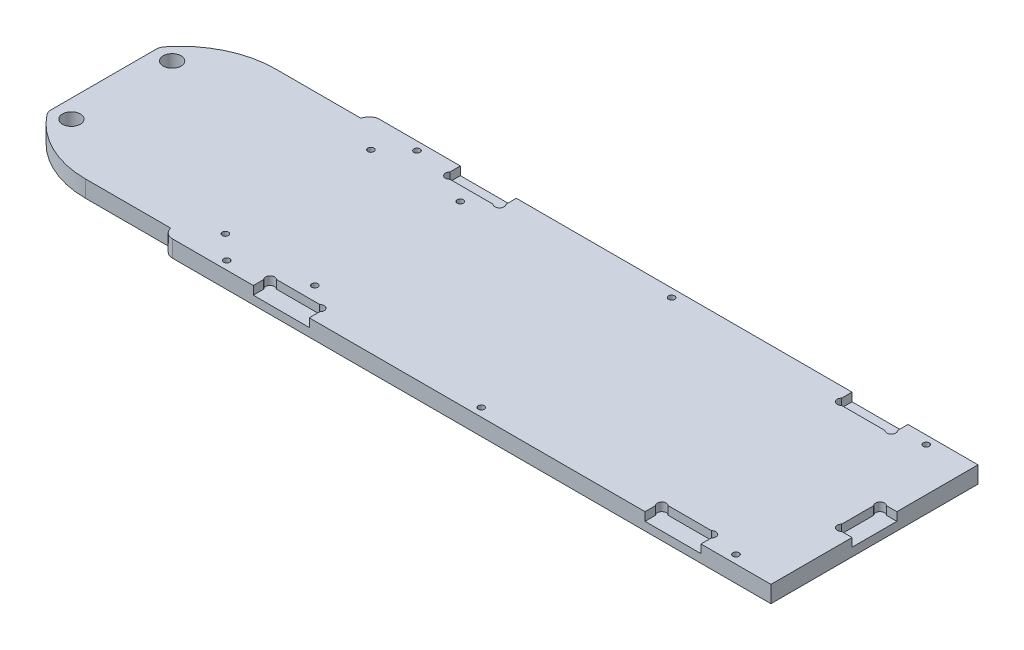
ISO-10303-21;
HEADER;
FILE_DESCRIPTION(('STEP AP214'),'2;1');
FILE_NAME('part.step','',(''),(''),'','','');
FILE_SCHEMA(('AUTOMOTIVE_DESIGN { 1 0 10303 214 1 1 1 1 }'));
ENDSEC;
DATA;
#1=APPLICATION_CONTEXT('core data for automotive mechanical design processes');
#2=APPLICATION_PROTOCOL_DEFINITION('international standard','automotive_design',2000,#1);
#3=PRODUCT_CONTEXT('',#1,'mechanical');
#4=PRODUCT('Part','Part','',(#3));
#5=PRODUCT_RELATED_PRODUCT_CATEGORY('part','',(#4));
#6=PRODUCT_DEFINITION_FORMATION('','',#4);
#7=PRODUCT_DEFINITION_CONTEXT('part definition',#1,'design');
#8=PRODUCT_DEFINITION('design','',#6,#7);
#9=PRODUCT_DEFINITION_SHAPE('','',#8);
#10=(LENGTH_UNIT() NAMED_UNIT(*) SI_UNIT(.MILLI.,.METRE.));
#11=(NAMED_UNIT(*) PLANE_ANGLE_UNIT() SI_UNIT($,.RADIAN.));
#12=(NAMED_UNIT(*) SI_UNIT($,.STERADIAN.) SOLID_ANGLE_UNIT());
#13=UNCERTAINTY_MEASURE_WITH_UNIT(LENGTH_MEASURE(1.E-05),#10,'distance_accuracy_value','');
#14=(GEOMETRIC_REPRESENTATION_CONTEXT(3) GLOBAL_UNCERTAINTY_ASSIGNED_CONTEXT((#13)) GLOBAL_UNIT_ASSIGNED_CONTEXT((#10,
#11,#12)) REPRESENTATION_CONTEXT('',''));
#15=CARTESIAN_POINT('',(0.,0.,0.));
#16=DIRECTION('',(0.,0.,1.));
#17=DIRECTION('',(1.,0.,0.));
#18=AXIS2_PLACEMENT_3D('',#15,#16,#17);
#19=CARTESIAN_POINT('',(-3.86681966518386,6.,-3.69999999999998));
#20=DIRECTION('',(0.,-1.,0.));
#21=DIRECTION('',(0.,0.,-1.));
#22=AXIS2_PLACEMENT_3D('',#19,#20,#21);
#23=PLANE('',#22);
#24=DIRECTION('',(0.,0.,1.));
#25=VECTOR('',#24,1.);
#26=CARTESIAN_POINT('',(-65.5,6.,-56.9937498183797));
#27=LINE('',#26,#25);
#28=CARTESIAN_POINT('',(-65.5,6.,-55.7523339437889));
#29=VERTEX_POINT('',#28);
#30=CARTESIAN_POINT('',(-65.5,6.,-18.2476660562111));
#31=VERTEX_POINT('',#30);
#32=EDGE_CURVE('E619',#29,#31,#27,.T.);
#33=ORIENTED_EDGE('',*,*,#32,.T.);
#34=CARTESIAN_POINT('',(-61.8,6.,-18.2476660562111));
#35=DIRECTION('',(0.,-1.,0.));
#36=DIRECTION('',(0.,0.,-1.));
#37=AXIS2_PLACEMENT_3D('',#34,#35,#36);
#38=CIRCLE('',#37,3.7);
#39=CARTESIAN_POINT('',(-64.7062705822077,6.,-15.95777712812));
#40=VERTEX_POINT('',#39);
#41=EDGE_CURVE('E41',#31,#40,#38,.F.);
#42=ORIENTED_EDGE('',*,*,#41,.T.);
#43=CARTESIAN_POINT('',(-38.,6.,-37.));
#44=DIRECTION('',(0.,1.,0.));
#45=DIRECTION('',(0.,0.,1.));
#46=AXIS2_PLACEMENT_3D('',#43,#44,#45);
#47=CIRCLE('',#46,34.0000004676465);
#48=CARTESIAN_POINT('',(-38.,6.,-2.99999953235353));
#49=VERTEX_POINT('',#48);
#50=EDGE_CURVE('E621',#40,#49,#47,.T.);
#51=ORIENTED_EDGE('',*,*,#50,.T.);
#52=DIRECTION('',(1.,0.,0.));
#53=VECTOR('',#52,1.);
#54=CARTESIAN_POINT('',(-38.,6.,-2.99999953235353));
#55=LINE('',#54,#53);
#56=CARTESIAN_POINT('',(-7.49999999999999,6.,-2.99999953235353));
#57=VERTEX_POINT('',#56);
#58=EDGE_CURVE('E623',#49,#57,#55,.T.);
#59=ORIENTED_EDGE('',*,*,#58,.T.);
#60=CARTESIAN_POINT('',(-3.86681966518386,6.,-3.69999999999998));
#61=DIRECTION('',(0.,1.,0.));
#62=DIRECTION('',(0.,0.,-1.));
#63=AXIS2_PLACEMENT_3D('',#60,#61,#62);
#64=CIRCLE('',#63,3.69999999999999);
#65=CARTESIAN_POINT('',(-3.86681966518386,6.,0.));
#66=VERTEX_POINT('',#65);
#67=EDGE_CURVE('E625',#57,#66,#64,.T.);
#68=ORIENTED_EDGE('',*,*,#67,.T.);
#69=DIRECTION('',(1.,0.,0.));
#70=VECTOR('',#69,1.);
#71=CARTESIAN_POINT('',(-3.86681966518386,6.,0.));
#72=LINE('',#71,#70);
#73=CARTESIAN_POINT('',(25.,6.,0.));
#74=VERTEX_POINT('',#73);
#75=EDGE_CURVE('E628',#66,#74,#72,.T.);
#76=ORIENTED_EDGE('',*,*,#75,.T.);
#77=DIRECTION('',(0.,0.,1.));
#78=VECTOR('',#77,1.);
#79=CARTESIAN_POINT('',(25.,6.,-3.73725830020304));
#80=LINE('',#79,#78);
#81=CARTESIAN_POINT('',(25.,6.,-3.73725830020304));
#82=VERTEX_POINT('',#81);
#83=EDGE_CURVE('E384',#82,#74,#80,.T.);
#84=ORIENTED_EDGE('',*,*,#83,.F.);
#85=CARTESIAN_POINT('',(26.1313708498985,6.,-4.86862915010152));
#86=DIRECTION('',(0.,1.,0.));
#87=DIRECTION('',(0.,0.,-1.));
#88=AXIS2_PLACEMENT_3D('',#85,#86,#87);
#89=CIRCLE('',#88,1.59999999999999);
#90=CARTESIAN_POINT('',(27.2627416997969,6.,-6.));
#91=VERTEX_POINT('',#90);
#92=EDGE_CURVE('E381',#91,#82,#89,.T.);
#93=ORIENTED_EDGE('',*,*,#92,.F.);
#94=DIRECTION('',(-1.,0.,0.));
#95=VECTOR('',#94,1.);
#96=CARTESIAN_POINT('',(27.2627416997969,6.,-6.));
#97=LINE('',#96,#95);
#98=CARTESIAN_POINT('',(42.7372583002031,6.,-6.));
#99=VERTEX_POINT('',#98);
#100=EDGE_CURVE('E378',#99,#91,#97,.T.);
#101=ORIENTED_EDGE('',*,*,#100,.F.);
#102=CARTESIAN_POINT('',(43.8686291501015,6.,-4.86862915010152));
#103=DIRECTION('',(0.,1.,0.));
#104=DIRECTION('',(0.,0.,1.));
#105=AXIS2_PLACEMENT_3D('',#102,#103,#104);
#106=CIRCLE('',#105,1.59999999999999);
#107=CARTESIAN_POINT('',(45.,6.,-3.73725830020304));
#108=VERTEX_POINT('',#107);
#109=EDGE_CURVE('E349',#108,#99,#106,.T.);
#110=ORIENTED_EDGE('',*,*,#109,.F.);
#111=DIRECTION('',(0.,0.,-1.));
#112=VECTOR('',#111,1.);
#113=CARTESIAN_POINT('',(45.,6.,-3.73725830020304));
#114=LINE('',#113,#112);
#115=CARTESIAN_POINT('',(45.,6.,0.));
#116=VERTEX_POINT('',#115);
#117=EDGE_CURVE('E362',#116,#108,#114,.T.);
#118=ORIENTED_EDGE('',*,*,#117,.F.);
#119=CARTESIAN_POINT('',(165.,6.,0.));
#120=VERTEX_POINT('',#119);
#121=EDGE_CURVE('E632',#116,#120,#72,.T.);
#122=ORIENTED_EDGE('',*,*,#121,.T.);
#123=DIRECTION('',(0.,0.,1.));
#124=VECTOR('',#123,1.);
#125=CARTESIAN_POINT('',(165.,6.,-3.73725830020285));
#126=LINE('',#125,#124);
#127=CARTESIAN_POINT('',(165.,6.,-3.73725830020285));
#128=VERTEX_POINT('',#127);
#129=EDGE_CURVE('E427',#128,#120,#126,.T.);
#130=ORIENTED_EDGE('',*,*,#129,.F.);
#131=CARTESIAN_POINT('',(166.131370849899,6.,-4.86862915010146));
#132=DIRECTION('',(0.,1.,0.));
#133=DIRECTION('',(0.,0.,-1.));
#134=AXIS2_PLACEMENT_3D('',#131,#132,#133);
#135=CIRCLE('',#134,1.60000000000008);
#136=CARTESIAN_POINT('',(167.262741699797,6.,-5.99999999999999));
#137=VERTEX_POINT('',#136);
#138=EDGE_CURVE('E424',#137,#128,#135,.T.);
#139=ORIENTED_EDGE('',*,*,#138,.F.);
#140=DIRECTION('',(-1.,0.,0.));
#141=VECTOR('',#140,1.);
#142=CARTESIAN_POINT('',(182.737258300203,6.,-5.99999999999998));
#143=LINE('',#142,#141);
#144=CARTESIAN_POINT('',(182.737258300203,6.,-5.99999999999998));
#145=VERTEX_POINT('',#144);
#146=EDGE_CURVE('E421',#145,#137,#143,.T.);
#147=ORIENTED_EDGE('',*,*,#146,.F.);
#148=CARTESIAN_POINT('',(183.868629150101,6.,-4.86862915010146));
#149=DIRECTION('',(0.,1.,0.));
#150=DIRECTION('',(0.,0.,1.));
#151=AXIS2_PLACEMENT_3D('',#148,#149,#150);
#152=CIRCLE('',#151,1.60000000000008);
#153=CARTESIAN_POINT('',(185.,6.,-3.73725830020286));
#154=VERTEX_POINT('',#153);
#155=EDGE_CURVE('E390',#154,#145,#152,.T.);
#156=ORIENTED_EDGE('',*,*,#155,.F.);
#157=DIRECTION('',(0.,0.,-1.));
#158=VECTOR('',#157,1.);
#159=CARTESIAN_POINT('',(185.,6.,-3.73725830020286));
#160=LINE('',#159,#158);
#161=CARTESIAN_POINT('',(185.,6.,0.));
#162=VERTEX_POINT('',#161);
#163=EDGE_CURVE('E405',#162,#154,#160,.T.);
#164=ORIENTED_EDGE('',*,*,#163,.F.);
#165=CARTESIAN_POINT('',(210.,6.,0.));
#166=VERTEX_POINT('',#165);
#167=EDGE_CURVE('E627',#162,#166,#72,.T.);
#168=ORIENTED_EDGE('',*,*,#167,.T.);
#169=DIRECTION('',(0.,0.,-1.));
#170=VECTOR('',#169,1.);
#171=CARTESIAN_POINT('',(210.,6.,-74.));
#172=LINE('',#171,#170);
#173=CARTESIAN_POINT('',(210.,6.,-29.));
#174=VERTEX_POINT('',#173);
#175=EDGE_CURVE('E604',#166,#174,#172,.T.);
#176=ORIENTED_EDGE('',*,*,#175,.T.);
#177=DIRECTION('',(1.,0.,0.));
#178=VECTOR('',#177,1.);
#179=CARTESIAN_POINT('',(206.262741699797,6.,-29.));
#180=LINE('',#179,#178);
#181=CARTESIAN_POINT('',(206.262741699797,6.,-29.));
#182=VERTEX_POINT('',#181);
#183=EDGE_CURVE('E331',#182,#174,#180,.T.);
#184=ORIENTED_EDGE('',*,*,#183,.F.);
#185=CARTESIAN_POINT('',(205.131370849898,6.,-30.1313708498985));
#186=DIRECTION('',(0.,1.,0.));
#187=DIRECTION('',(0.,0.,-1.));
#188=AXIS2_PLACEMENT_3D('',#185,#186,#187);
#189=CIRCLE('',#188,1.60000000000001);
#190=CARTESIAN_POINT('',(204.,6.,-31.262741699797));
#191=VERTEX_POINT('',#190);
#192=EDGE_CURVE('E343',#191,#182,#189,.T.);
#193=ORIENTED_EDGE('',*,*,#192,.F.);
#194=DIRECTION('',(0.,0.,1.));
#195=VECTOR('',#194,1.);
#196=CARTESIAN_POINT('',(204.,6.,-42.737258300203));
#197=LINE('',#196,#195);
#198=CARTESIAN_POINT('',(204.,6.,-42.737258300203));
#199=VERTEX_POINT('',#198);
#200=EDGE_CURVE('E341',#199,#191,#197,.T.);
#201=ORIENTED_EDGE('',*,*,#200,.F.);
#202=CARTESIAN_POINT('',(205.131370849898,6.,-43.8686291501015));
#203=DIRECTION('',(0.,1.,0.));
#204=DIRECTION('',(0.,0.,1.));
#205=AXIS2_PLACEMENT_3D('',#202,#203,#204);
#206=CIRCLE('',#205,1.60000000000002);
#207=CARTESIAN_POINT('',(206.262741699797,6.,-45.));
#208=VERTEX_POINT('',#207);
#209=EDGE_CURVE('E311',#208,#199,#206,.T.);
#210=ORIENTED_EDGE('',*,*,#209,.F.);
#211=DIRECTION('',(-1.,0.,0.));
#212=VECTOR('',#211,1.);
#213=CARTESIAN_POINT('',(206.262741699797,6.,-45.));
#214=LINE('',#213,#212);
#215=CARTESIAN_POINT('',(210.,6.,-45.));
#216=VERTEX_POINT('',#215);
#217=EDGE_CURVE('E328',#216,#208,#214,.T.);
#218=ORIENTED_EDGE('',*,*,#217,.F.);
#219=CARTESIAN_POINT('',(210.,6.,-74.));
#220=VERTEX_POINT('',#219);
#221=EDGE_CURVE('E608',#216,#220,#172,.T.);
#222=ORIENTED_EDGE('',*,*,#221,.T.);
#223=DIRECTION('',(-1.,0.,0.));
#224=VECTOR('',#223,1.);
#225=CARTESIAN_POINT('',(-3.86681966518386,6.,-74.));
#226=LINE('',#225,#224);
#227=CARTESIAN_POINT('',(185.,6.,-74.));
#228=VERTEX_POINT('',#227);
#229=EDGE_CURVE('E609',#220,#228,#226,.T.);
#230=ORIENTED_EDGE('',*,*,#229,.T.);
#231=DIRECTION('',(0.,0.,-1.));
#232=VECTOR('',#231,1.);
#233=CARTESIAN_POINT('',(185.,6.,-70.2627416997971));
#234=LINE('',#233,#232);
#235=CARTESIAN_POINT('',(185.,6.,-70.2627416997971));
#236=VERTEX_POINT('',#235);
#237=EDGE_CURVE('E471',#236,#228,#234,.T.);
#238=ORIENTED_EDGE('',*,*,#237,.F.);
#239=CARTESIAN_POINT('',(183.868629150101,6.,-69.1313708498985));
#240=DIRECTION('',(0.,1.,0.));
#241=DIRECTION('',(0.,0.,-1.));
#242=AXIS2_PLACEMENT_3D('',#239,#240,#241);
#243=CIRCLE('',#242,1.60000000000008);
#244=CARTESIAN_POINT('',(182.737258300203,6.,-68.));
#245=VERTEX_POINT('',#244);
#246=EDGE_CURVE('E468',#245,#236,#243,.T.);
#247=ORIENTED_EDGE('',*,*,#246,.F.);
#248=DIRECTION('',(1.,0.,0.));
#249=VECTOR('',#248,1.);
#250=CARTESIAN_POINT('',(182.737258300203,6.,-68.));
#251=LINE('',#250,#249);
#252=CARTESIAN_POINT('',(167.262741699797,6.,-68.));
#253=VERTEX_POINT('',#252);
#254=EDGE_CURVE('E465',#253,#245,#251,.T.);
#255=ORIENTED_EDGE('',*,*,#254,.F.);
#256=CARTESIAN_POINT('',(166.131370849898,6.,-69.1313708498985));
#257=DIRECTION('',(0.,1.,0.));
#258=DIRECTION('',(0.,0.,1.));
#259=AXIS2_PLACEMENT_3D('',#256,#257,#258);
#260=CIRCLE('',#259,1.60000000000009);
#261=CARTESIAN_POINT('',(165.,6.,-70.2627416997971));
#262=VERTEX_POINT('',#261);
#263=EDGE_CURVE('E434',#262,#253,#260,.T.);
#264=ORIENTED_EDGE('',*,*,#263,.F.);
#265=DIRECTION('',(0.,0.,1.));
#266=VECTOR('',#265,1.);
#267=CARTESIAN_POINT('',(165.,6.,-70.2627416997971));
#268=LINE('',#267,#266);
#269=CARTESIAN_POINT('',(165.,6.,-74.));
#270=VERTEX_POINT('',#269);
#271=EDGE_CURVE('E449',#270,#262,#268,.T.);
#272=ORIENTED_EDGE('',*,*,#271,.F.);
#273=CARTESIAN_POINT('',(45.,6.,-74.));
#274=VERTEX_POINT('',#273);
#275=EDGE_CURVE('E613',#270,#274,#226,.T.);
#276=ORIENTED_EDGE('',*,*,#275,.T.);
#277=DIRECTION('',(0.,0.,-1.));
#278=VECTOR('',#277,1.);
#279=CARTESIAN_POINT('',(45.,6.,-70.2627416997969));
#280=LINE('',#279,#278);
#281=CARTESIAN_POINT('',(45.,6.,-70.2627416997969));
#282=VERTEX_POINT('',#281);
#283=EDGE_CURVE('E514',#282,#274,#280,.T.);
#284=ORIENTED_EDGE('',*,*,#283,.F.);
#285=CARTESIAN_POINT('',(43.8686291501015,6.,-69.1313708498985));
#286=DIRECTION('',(0.,1.,0.));
#287=DIRECTION('',(0.,0.,-1.));
#288=AXIS2_PLACEMENT_3D('',#285,#286,#287);
#289=CIRCLE('',#288,1.59999999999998);
#290=CARTESIAN_POINT('',(42.7372583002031,6.,-68.));
#291=VERTEX_POINT('',#290);
#292=EDGE_CURVE('E511',#291,#282,#289,.T.);
#293=ORIENTED_EDGE('',*,*,#292,.F.);
#294=DIRECTION('',(1.,0.,0.));
#295=VECTOR('',#294,1.);
#296=CARTESIAN_POINT('',(27.2627416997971,6.,-68.));
#297=LINE('',#296,#295);
#298=CARTESIAN_POINT('',(27.2627416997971,6.,-68.));
#299=VERTEX_POINT('',#298);
#300=EDGE_CURVE('E508',#299,#291,#297,.T.);
#301=ORIENTED_EDGE('',*,*,#300,.F.);
#302=CARTESIAN_POINT('',(26.1313708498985,6.,-69.1313708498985));
#303=DIRECTION('',(0.,1.,0.));
#304=DIRECTION('',(0.,0.,1.));
#305=AXIS2_PLACEMENT_3D('',#302,#303,#304);
#306=CIRCLE('',#305,1.60000000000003);
#307=CARTESIAN_POINT('',(25.,6.,-70.2627416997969));
#308=VERTEX_POINT('',#307);
#309=EDGE_CURVE('E477',#308,#299,#306,.T.);
#310=ORIENTED_EDGE('',*,*,#309,.F.);
#311=DIRECTION('',(0.,0.,1.));
#312=VECTOR('',#311,1.);
#313=CARTESIAN_POINT('',(25.,6.,-70.2627416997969));
#314=LINE('',#313,#312);
#315=CARTESIAN_POINT('',(25.,6.,-74.));
#316=VERTEX_POINT('',#315);
#317=EDGE_CURVE('E492',#316,#308,#314,.T.);
#318=ORIENTED_EDGE('',*,*,#317,.F.);
#319=CARTESIAN_POINT('',(-3.86681966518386,6.,-74.));
#320=VERTEX_POINT('',#319);
#321=EDGE_CURVE('E607',#316,#320,#226,.T.);
#322=ORIENTED_EDGE('',*,*,#321,.T.);
#323=CARTESIAN_POINT('',(-3.86681966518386,6.,-70.3));
#324=DIRECTION('',(0.,1.,0.));
#325=DIRECTION('',(0.,0.,1.));
#326=AXIS2_PLACEMENT_3D('',#323,#324,#325);
#327=CIRCLE('',#326,3.69999999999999);
#328=CARTESIAN_POINT('',(-7.5,6.,-71.0000004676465));
#329=VERTEX_POINT('',#328);
#330=EDGE_CURVE('E612',#320,#329,#327,.T.);
#331=ORIENTED_EDGE('',*,*,#330,.T.);
#332=DIRECTION('',(-1.,0.,0.));
#333=VECTOR('',#332,1.);
#334=CARTESIAN_POINT('',(-38.,6.,-71.0000004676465));
#335=LINE('',#334,#333);
#336=CARTESIAN_POINT('',(-38.,6.,-71.0000004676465));
#337=VERTEX_POINT('',#336);
#338=EDGE_CURVE('E615',#329,#337,#335,.T.);
#339=ORIENTED_EDGE('',*,*,#338,.T.);
#340=CARTESIAN_POINT('',(-38.,6.,-37.));
#341=DIRECTION('',(0.,1.,0.));
#342=DIRECTION('',(0.,0.,1.));
#343=AXIS2_PLACEMENT_3D('',#340,#341,#342);
#344=CIRCLE('',#343,34.0000004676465);
#345=CARTESIAN_POINT('',(-64.7062705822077,6.,-58.04222287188));
#346=VERTEX_POINT('',#345);
#347=EDGE_CURVE('E617',#337,#346,#344,.T.);
#348=ORIENTED_EDGE('',*,*,#347,.T.);
#349=CARTESIAN_POINT('',(-61.8,6.,-55.7523339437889));
#350=DIRECTION('',(0.,-1.,0.));
#351=DIRECTION('',(0.,0.,-1.));
#352=AXIS2_PLACEMENT_3D('',#349,#350,#351);
#353=CIRCLE('',#352,3.7);
#354=EDGE_CURVE('E687',#346,#29,#353,.F.);
#355=ORIENTED_EDGE('',*,*,#354,.T.);
#356=EDGE_LOOP('',(#33,#42,#51,#59,#68,#76,#84,#93,#101,#110,#118,#122,#130,#139,#147,#156,#164,
#168,#176,#184,#193,#201,#210,#218,#222,#230,#238,#247,#255,#264,#272,#276,#284,#293,#301,#310,
#318,#322,#331,#339,#348,#355));
#357=FACE_BOUND('',#356,.T.);
#358=CARTESIAN_POINT('',(12.5,6.,-71.0000004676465));
#359=DIRECTION('',(0.,1.,0.));
#360=DIRECTION('',(0.,0.,1.));
#361=AXIS2_PLACEMENT_3D('',#358,#359,#360);
#362=CIRCLE('',#361,1.1);
#363=CARTESIAN_POINT('',(12.5,6.,-69.9000004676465));
#364=VERTEX_POINT('',#363);
#365=EDGE_CURVE('E598',#364,#364,#362,.T.);
#366=ORIENTED_EDGE('',*,*,#365,.F.);
#367=EDGE_LOOP('',(#366));
#368=FACE_BOUND('',#367,.T.);
#369=CARTESIAN_POINT('',(194.5,6.,-71.0000004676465));
#370=DIRECTION('',(0.,1.,0.));
#371=DIRECTION('',(0.,0.,-1.));
#372=AXIS2_PLACEMENT_3D('',#369,#370,#371);
#373=CIRCLE('',#372,1.10000000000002);
#374=CARTESIAN_POINT('',(194.5,6.,-72.1000004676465));
#375=VERTEX_POINT('',#374);
#376=EDGE_CURVE('E592',#375,#375,#373,.T.);
#377=ORIENTED_EDGE('',*,*,#376,.F.);
#378=EDGE_LOOP('',(#377));
#379=FACE_BOUND('',#378,.T.);
#380=CARTESIAN_POINT('',(103.5,6.,-71.));
#381=DIRECTION('',(0.,1.,0.));
#382=DIRECTION('',(0.,0.,1.));
#383=AXIS2_PLACEMENT_3D('',#380,#381,#382);
#384=CIRCLE('',#383,1.10000000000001);
#385=CARTESIAN_POINT('',(103.5,6.,-69.9));
#386=VERTEX_POINT('',#385);
#387=EDGE_CURVE('E586',#386,#386,#384,.T.);
#388=ORIENTED_EDGE('',*,*,#387,.F.);
#389=EDGE_LOOP('',(#388));
#390=FACE_BOUND('',#389,.T.);
#391=CARTESIAN_POINT('',(103.5,6.,-3.));
#392=DIRECTION('',(0.,1.,0.));
#393=DIRECTION('',(0.,0.,-1.));
#394=AXIS2_PLACEMENT_3D('',#391,#392,#393);
#395=CIRCLE('',#394,1.10000000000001);
#396=CARTESIAN_POINT('',(103.5,6.,-4.10000000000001));
#397=VERTEX_POINT('',#396);
#398=EDGE_CURVE('E580',#397,#397,#395,.T.);
#399=ORIENTED_EDGE('',*,*,#398,.F.);
#400=EDGE_LOOP('',(#399));
#401=FACE_BOUND('',#400,.T.);
#402=CARTESIAN_POINT('',(194.5,6.,-2.9999995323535));
#403=DIRECTION('',(0.,1.,0.));
#404=DIRECTION('',(0.,0.,1.));
#405=AXIS2_PLACEMENT_3D('',#402,#403,#404);
#406=CIRCLE('',#405,1.10000000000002);
#407=CARTESIAN_POINT('',(194.5,6.,-1.89999953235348));
#408=VERTEX_POINT('',#407);
#409=EDGE_CURVE('E574',#408,#408,#406,.T.);
#410=ORIENTED_EDGE('',*,*,#409,.F.);
#411=EDGE_LOOP('',(#410));
#412=FACE_BOUND('',#411,.T.);
#413=CARTESIAN_POINT('',(12.5,6.,-2.99999953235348));
#414=DIRECTION('',(0.,1.,0.));
#415=DIRECTION('',(0.,0.,-1.));
#416=AXIS2_PLACEMENT_3D('',#413,#414,#415);
#417=CIRCLE('',#416,1.1);
#418=CARTESIAN_POINT('',(12.5,6.,-4.09999953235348));
#419=VERTEX_POINT('',#418);
#420=EDGE_CURVE('E568',#419,#419,#417,.T.);
#421=ORIENTED_EDGE('',*,*,#420,.F.);
#422=EDGE_LOOP('',(#421));
#423=FACE_BOUND('',#422,.T.);
#424=CARTESIAN_POINT('',(4.,6.,-63.));
#425=DIRECTION('',(0.,1.,0.));
#426=DIRECTION('',(0.,0.,1.));
#427=AXIS2_PLACEMENT_3D('',#424,#425,#426);
#428=CIRCLE('',#427,1.1);
#429=CARTESIAN_POINT('',(4.,6.,-61.9));
#430=VERTEX_POINT('',#429);
#431=EDGE_CURVE('E562',#430,#430,#428,.T.);
#432=ORIENTED_EDGE('',*,*,#431,.F.);
#433=EDGE_LOOP('',(#432));
#434=FACE_BOUND('',#433,.T.);
#435=CARTESIAN_POINT('',(36.,6.,-63.));
#436=DIRECTION('',(0.,1.,0.));
#437=DIRECTION('',(0.,0.,-1.));
#438=AXIS2_PLACEMENT_3D('',#435,#436,#437);
#439=CIRCLE('',#438,1.10000000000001);
#440=CARTESIAN_POINT('',(36.,6.,-64.1));
#441=VERTEX_POINT('',#440);
#442=EDGE_CURVE('E556',#441,#441,#439,.T.);
#443=ORIENTED_EDGE('',*,*,#442,.F.);
#444=EDGE_LOOP('',(#443));
#445=FACE_BOUND('',#444,.T.);
#446=CARTESIAN_POINT('',(36.,6.,-11.));
#447=DIRECTION('',(0.,1.,0.));
#448=DIRECTION('',(0.,0.,1.));
#449=AXIS2_PLACEMENT_3D('',#446,#447,#448);
#450=CIRCLE('',#449,1.10000000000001);
#451=CARTESIAN_POINT('',(36.,6.,-9.89999999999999));
#452=VERTEX_POINT('',#451);
#453=EDGE_CURVE('E550',#452,#452,#450,.T.);
#454=ORIENTED_EDGE('',*,*,#453,.F.);
#455=EDGE_LOOP('',(#454));
#456=FACE_BOUND('',#455,.T.);
#457=CARTESIAN_POINT('',(4.,6.,-11.));
#458=DIRECTION('',(0.,1.,0.));
#459=DIRECTION('',(0.,0.,-1.));
#460=AXIS2_PLACEMENT_3D('',#457,#458,#459);
#461=CIRCLE('',#460,1.1);
#462=CARTESIAN_POINT('',(4.,6.,-12.1));
#463=VERTEX_POINT('',#462);
#464=EDGE_CURVE('E544',#463,#463,#461,.T.);
#465=ORIENTED_EDGE('',*,*,#464,.F.);
#466=EDGE_LOOP('',(#465));
#467=FACE_BOUND('',#466,.T.);
#468=CARTESIAN_POINT('',(-59.,6.,-55.));
#469=DIRECTION('',(0.,1.,0.));
#470=DIRECTION('',(0.,0.,1.));
#471=AXIS2_PLACEMENT_3D('',#468,#469,#470);
#472=CIRCLE('',#471,3.2);
#473=CARTESIAN_POINT('',(-59.,6.,-51.8));
#474=VERTEX_POINT('',#473);
#475=EDGE_CURVE('E538',#474,#474,#472,.T.);
#476=ORIENTED_EDGE('',*,*,#475,.F.);
#477=EDGE_LOOP('',(#476));
#478=FACE_BOUND('',#477,.T.);
#479=CARTESIAN_POINT('',(-59.,6.,-19.));
#480=DIRECTION('',(0.,1.,0.));
#481=DIRECTION('',(0.,0.,-1.));
#482=AXIS2_PLACEMENT_3D('',#479,#480,#481);
#483=CIRCLE('',#482,3.2);
#484=CARTESIAN_POINT('',(-59.,6.,-22.2));
#485=VERTEX_POINT('',#484);
#486=EDGE_CURVE('E532',#485,#485,#483,.T.);
#487=ORIENTED_EDGE('',*,*,#486,.F.);
#488=EDGE_LOOP('',(#487));
#489=FACE_BOUND('',#488,.T.);
#490=ADVANCED_FACE('F33',(#357,#368,#379,#390,#401,#412,#423,#434,#445,#456,#467,#478,#489),#23,.F.);
#491=CARTESIAN_POINT('',(-3.86681966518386,0.,-3.69999999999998));
#492=DIRECTION('',(0.,-1.,0.));
#493=DIRECTION('',(0.,0.,-1.));
#494=AXIS2_PLACEMENT_3D('',#491,#492,#493);
#495=PLANE('',#494);
#496=CARTESIAN_POINT('',(-59.,0.,-55.));
#497=DIRECTION('',(0.,1.,0.));
#498=DIRECTION('',(0.,0.,1.));
#499=AXIS2_PLACEMENT_3D('',#496,#497,#498);
#500=CIRCLE('',#499,3.2);
#501=CARTESIAN_POINT('',(-59.,0.,-51.8));
#502=VERTEX_POINT('',#501);
#503=EDGE_CURVE('E535',#502,#502,#500,.T.);
#504=ORIENTED_EDGE('',*,*,#503,.T.);
#505=EDGE_LOOP('',(#504));
#506=FACE_BOUND('',#505,.T.);
#507=CARTESIAN_POINT('',(36.,0.,-11.));
#508=DIRECTION('',(0.,1.,0.));
#509=DIRECTION('',(0.,0.,1.));
#510=AXIS2_PLACEMENT_3D('',#507,#508,#509);
#511=CIRCLE('',#510,1.10000000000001);
#512=CARTESIAN_POINT('',(36.,0.,-9.89999999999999));
#513=VERTEX_POINT('',#512);
#514=EDGE_CURVE('E547',#513,#513,#511,.T.);
#515=ORIENTED_EDGE('',*,*,#514,.T.);
#516=EDGE_LOOP('',(#515));
#517=FACE_BOUND('',#516,.T.);
#518=CARTESIAN_POINT('',(4.,0.,-63.));
#519=DIRECTION('',(0.,1.,0.));
#520=DIRECTION('',(0.,0.,1.));
#521=AXIS2_PLACEMENT_3D('',#518,#519,#520);
#522=CIRCLE('',#521,1.1);
#523=CARTESIAN_POINT('',(4.,0.,-61.9));
#524=VERTEX_POINT('',#523);
#525=EDGE_CURVE('E559',#524,#524,#522,.T.);
#526=ORIENTED_EDGE('',*,*,#525,.T.);
#527=EDGE_LOOP('',(#526));
#528=FACE_BOUND('',#527,.T.);
#529=CARTESIAN_POINT('',(194.5,0.,-2.9999995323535));
#530=DIRECTION('',(0.,1.,0.));
#531=DIRECTION('',(0.,0.,1.));
#532=AXIS2_PLACEMENT_3D('',#529,#530,#531);
#533=CIRCLE('',#532,1.10000000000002);
#534=CARTESIAN_POINT('',(194.5,0.,-1.89999953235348));
#535=VERTEX_POINT('',#534);
#536=EDGE_CURVE('E571',#535,#535,#533,.T.);
#537=ORIENTED_EDGE('',*,*,#536,.T.);
#538=EDGE_LOOP('',(#537));
#539=FACE_BOUND('',#538,.T.);
#540=CARTESIAN_POINT('',(103.5,0.,-71.));
#541=DIRECTION('',(0.,1.,0.));
#542=DIRECTION('',(0.,0.,1.));
#543=AXIS2_PLACEMENT_3D('',#540,#541,#542);
#544=CIRCLE('',#543,1.10000000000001);
#545=CARTESIAN_POINT('',(103.5,0.,-69.9));
#546=VERTEX_POINT('',#545);
#547=EDGE_CURVE('E583',#546,#546,#544,.T.);
#548=ORIENTED_EDGE('',*,*,#547,.T.);
#549=EDGE_LOOP('',(#548));
#550=FACE_BOUND('',#549,.T.);
#551=CARTESIAN_POINT('',(12.5,0.,-71.0000004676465));
#552=DIRECTION('',(0.,1.,0.));
#553=DIRECTION('',(0.,0.,1.));
#554=AXIS2_PLACEMENT_3D('',#551,#552,#553);
#555=CIRCLE('',#554,1.1);
#556=CARTESIAN_POINT('',(12.5,0.,-69.9000004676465));
#557=VERTEX_POINT('',#556);
#558=EDGE_CURVE('E595',#557,#557,#555,.T.);
#559=ORIENTED_EDGE('',*,*,#558,.T.);
#560=EDGE_LOOP('',(#559));
#561=FACE_BOUND('',#560,.T.);
#562=CARTESIAN_POINT('',(-38.,0.,-37.));
#563=DIRECTION('',(0.,1.,0.));
#564=DIRECTION('',(0.,0.,1.));
#565=AXIS2_PLACEMENT_3D('',#562,#563,#564);
#566=CIRCLE('',#565,34.0000004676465);
#567=CARTESIAN_POINT('',(-64.7062705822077,0.,-15.95777712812));
#568=VERTEX_POINT('',#567);
#569=CARTESIAN_POINT('',(-38.,0.,-2.99999953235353));
#570=VERTEX_POINT('',#569);
#571=EDGE_CURVE('E645',#568,#570,#566,.T.);
#572=ORIENTED_EDGE('',*,*,#571,.F.);
#573=CARTESIAN_POINT('',(-61.8,0.,-18.2476660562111));
#574=DIRECTION('',(0.,-1.,0.));
#575=DIRECTION('',(0.,0.,-1.));
#576=AXIS2_PLACEMENT_3D('',#573,#574,#575);
#577=CIRCLE('',#576,3.7);
#578=CARTESIAN_POINT('',(-65.5,0.,-18.2476660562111));
#579=VERTEX_POINT('',#578);
#580=EDGE_CURVE('E681',#568,#579,#577,.T.);
#581=ORIENTED_EDGE('',*,*,#580,.T.);
#582=DIRECTION('',(0.,0.,1.));
#583=VECTOR('',#582,1.);
#584=CARTESIAN_POINT('',(-65.5,0.,-56.9937498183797));
#585=LINE('',#584,#583);
#586=CARTESIAN_POINT('',(-65.5,0.,-55.7523339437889));
#587=VERTEX_POINT('',#586);
#588=EDGE_CURVE('E643',#587,#579,#585,.T.);
#589=ORIENTED_EDGE('',*,*,#588,.F.);
#590=CARTESIAN_POINT('',(-61.8,0.,-55.7523339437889));
#591=DIRECTION('',(0.,-1.,0.));
#592=DIRECTION('',(0.,0.,-1.));
#593=AXIS2_PLACEMENT_3D('',#590,#591,#592);
#594=CIRCLE('',#593,3.7);
#595=CARTESIAN_POINT('',(-64.7062705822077,0.,-58.04222287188));
#596=VERTEX_POINT('',#595);
#597=EDGE_CURVE('E679',#587,#596,#594,.T.);
#598=ORIENTED_EDGE('',*,*,#597,.T.);
#599=CARTESIAN_POINT('',(-38.,0.,-37.));
#600=DIRECTION('',(0.,1.,0.));
#601=DIRECTION('',(0.,0.,1.));
#602=AXIS2_PLACEMENT_3D('',#599,#600,#601);
#603=CIRCLE('',#602,34.0000004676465);
#604=CARTESIAN_POINT('',(-38.,0.,-71.0000004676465));
#605=VERTEX_POINT('',#604);
#606=EDGE_CURVE('E641',#605,#596,#603,.T.);
#607=ORIENTED_EDGE('',*,*,#606,.F.);
#608=DIRECTION('',(-1.,0.,0.));
#609=VECTOR('',#608,1.);
#610=CARTESIAN_POINT('',(-38.,0.,-71.0000004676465));
#611=LINE('',#610,#609);
#612=CARTESIAN_POINT('',(-7.5,0.,-71.0000004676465));
#613=VERTEX_POINT('',#612);
#614=EDGE_CURVE('E639',#613,#605,#611,.T.);
#615=ORIENTED_EDGE('',*,*,#614,.F.);
#616=CARTESIAN_POINT('',(-3.86681966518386,0.,-70.3));
#617=DIRECTION('',(0.,1.,0.));
#618=DIRECTION('',(0.,0.,1.));
#619=AXIS2_PLACEMENT_3D('',#616,#617,#618);
#620=CIRCLE('',#619,3.69999999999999);
#621=CARTESIAN_POINT('',(-3.86681966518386,0.,-74.));
#622=VERTEX_POINT('',#621);
#623=EDGE_CURVE('E637',#622,#613,#620,.T.);
#624=ORIENTED_EDGE('',*,*,#623,.F.);
#625=DIRECTION('',(-1.,0.,0.));
#626=VECTOR('',#625,1.);
#627=CARTESIAN_POINT('',(-3.86681966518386,0.,-74.));
#628=LINE('',#627,#626);
#629=CARTESIAN_POINT('',(210.,0.,-74.));
#630=VERTEX_POINT('',#629);
#631=EDGE_CURVE('E635',#630,#622,#628,.T.);
#632=ORIENTED_EDGE('',*,*,#631,.F.);
#633=DIRECTION('',(0.,0.,-1.));
#634=VECTOR('',#633,1.);
#635=CARTESIAN_POINT('',(210.,0.,-74.));
#636=LINE('',#635,#634);
#637=CARTESIAN_POINT('',(210.,0.,0.));
#638=VERTEX_POINT('',#637);
#639=EDGE_CURVE('E601',#638,#630,#636,.T.);
#640=ORIENTED_EDGE('',*,*,#639,.F.);
#641=DIRECTION('',(1.,0.,0.));
#642=VECTOR('',#641,1.);
#643=CARTESIAN_POINT('',(-3.86681966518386,0.,0.));
#644=LINE('',#643,#642);
#645=CARTESIAN_POINT('',(-3.86681966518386,0.,0.));
#646=VERTEX_POINT('',#645);
#647=EDGE_CURVE('E651',#646,#638,#644,.T.);
#648=ORIENTED_EDGE('',*,*,#647,.F.);
#649=CARTESIAN_POINT('',(-3.86681966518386,0.,-3.69999999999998));
#650=DIRECTION('',(0.,1.,0.));
#651=DIRECTION('',(0.,0.,-1.));
#652=AXIS2_PLACEMENT_3D('',#649,#650,#651);
#653=CIRCLE('',#652,3.69999999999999);
#654=CARTESIAN_POINT('',(-7.49999999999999,0.,-2.99999953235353));
#655=VERTEX_POINT('',#654);
#656=EDGE_CURVE('E649',#655,#646,#653,.T.);
#657=ORIENTED_EDGE('',*,*,#656,.F.);
#658=DIRECTION('',(1.,0.,0.));
#659=VECTOR('',#658,1.);
#660=CARTESIAN_POINT('',(-38.,0.,-2.99999953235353));
#661=LINE('',#660,#659);
#662=EDGE_CURVE('E647',#570,#655,#661,.T.);
#663=ORIENTED_EDGE('',*,*,#662,.F.);
#664=EDGE_LOOP('',(#572,#581,#589,#598,#607,#615,#624,#632,#640,#648,#657,#663));
#665=FACE_BOUND('',#664,.T.);
#666=CARTESIAN_POINT('',(194.5,0.,-71.0000004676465));
#667=DIRECTION('',(0.,1.,0.));
#668=DIRECTION('',(0.,0.,-1.));
#669=AXIS2_PLACEMENT_3D('',#666,#667,#668);
#670=CIRCLE('',#669,1.10000000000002);
#671=CARTESIAN_POINT('',(194.5,0.,-72.1000004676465));
#672=VERTEX_POINT('',#671);
#673=EDGE_CURVE('E589',#672,#672,#670,.T.);
#674=ORIENTED_EDGE('',*,*,#673,.T.);
#675=EDGE_LOOP('',(#674));
#676=FACE_BOUND('',#675,.T.);
#677=CARTESIAN_POINT('',(103.5,0.,-3.));
#678=DIRECTION('',(0.,1.,0.));
#679=DIRECTION('',(0.,0.,-1.));
#680=AXIS2_PLACEMENT_3D('',#677,#678,#679);
#681=CIRCLE('',#680,1.10000000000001);
#682=CARTESIAN_POINT('',(103.5,0.,-4.10000000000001));
#683=VERTEX_POINT('',#682);
#684=EDGE_CURVE('E577',#683,#683,#681,.T.);
#685=ORIENTED_EDGE('',*,*,#684,.T.);
#686=EDGE_LOOP('',(#685));
#687=FACE_BOUND('',#686,.T.);
#688=CARTESIAN_POINT('',(12.5,0.,-2.99999953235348));
#689=DIRECTION('',(0.,1.,0.));
#690=DIRECTION('',(0.,0.,-1.));
#691=AXIS2_PLACEMENT_3D('',#688,#689,#690);
#692=CIRCLE('',#691,1.1);
#693=CARTESIAN_POINT('',(12.5,0.,-4.09999953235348));
#694=VERTEX_POINT('',#693);
#695=EDGE_CURVE('E565',#694,#694,#692,.T.);
#696=ORIENTED_EDGE('',*,*,#695,.T.);
#697=EDGE_LOOP('',(#696));
#698=FACE_BOUND('',#697,.T.);
#699=CARTESIAN_POINT('',(36.,0.,-63.));
#700=DIRECTION('',(0.,1.,0.));
#701=DIRECTION('',(0.,0.,-1.));
#702=AXIS2_PLACEMENT_3D('',#699,#700,#701);
#703=CIRCLE('',#702,1.10000000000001);
#704=CARTESIAN_POINT('',(36.,0.,-64.1));
#705=VERTEX_POINT('',#704);
#706=EDGE_CURVE('E553',#705,#705,#703,.T.);
#707=ORIENTED_EDGE('',*,*,#706,.T.);
#708=EDGE_LOOP('',(#707));
#709=FACE_BOUND('',#708,.T.);
#710=CARTESIAN_POINT('',(4.,0.,-11.));
#711=DIRECTION('',(0.,1.,0.));
#712=DIRECTION('',(0.,0.,-1.));
#713=AXIS2_PLACEMENT_3D('',#710,#711,#712);
#714=CIRCLE('',#713,1.1);
#715=CARTESIAN_POINT('',(4.,0.,-12.1));
#716=VERTEX_POINT('',#715);
#717=EDGE_CURVE('E541',#716,#716,#714,.T.);
#718=ORIENTED_EDGE('',*,*,#717,.T.);
#719=EDGE_LOOP('',(#718));
#720=FACE_BOUND('',#719,.T.);
#721=CARTESIAN_POINT('',(-59.,0.,-19.));
#722=DIRECTION('',(0.,1.,0.));
#723=DIRECTION('',(0.,0.,-1.));
#724=AXIS2_PLACEMENT_3D('',#721,#722,#723);
#725=CIRCLE('',#724,3.2);
#726=CARTESIAN_POINT('',(-59.,0.,-22.2));
#727=VERTEX_POINT('',#726);
#728=EDGE_CURVE('E521',#727,#727,#725,.T.);
#729=ORIENTED_EDGE('',*,*,#728,.T.);
#730=EDGE_LOOP('',(#729));
#731=FACE_BOUND('',#730,.T.);
#732=ADVANCED_FACE('F702',(#506,#517,#528,#539,#550,#561,#665,#676,#687,#698,#709,#720,#731),
#495,.T.);
#733=CARTESIAN_POINT('',(210.,6.,-74.));
#734=DIRECTION('',(-1.,0.,0.));
#735=DIRECTION('',(0.,0.,1.));
#736=AXIS2_PLACEMENT_3D('',#733,#734,#735);
#737=PLANE('',#736);
#738=ORIENTED_EDGE('',*,*,#221,.F.);
#739=DIRECTION('',(0.,1.,0.));
#740=VECTOR('',#739,1.);
#741=CARTESIAN_POINT('',(210.,3.,-45.));
#742=LINE('',#741,#740);
#743=CARTESIAN_POINT('',(210.,3.,-45.));
#744=VERTEX_POINT('',#743);
#745=EDGE_CURVE('E350',#744,#216,#742,.T.);
#746=ORIENTED_EDGE('',*,*,#745,.F.);
#747=DIRECTION('',(0.,0.,-1.));
#748=VECTOR('',#747,1.);
#749=CARTESIAN_POINT('',(210.,3.,-29.));
#750=LINE('',#749,#748);
#751=CARTESIAN_POINT('',(210.,3.,-29.));
#752=VERTEX_POINT('',#751);
#753=EDGE_CURVE('E337',#752,#744,#750,.T.);
#754=ORIENTED_EDGE('',*,*,#753,.F.);
#755=DIRECTION('',(0.,1.,0.));
#756=VECTOR('',#755,1.);
#757=CARTESIAN_POINT('',(210.,3.,-29.));
#758=LINE('',#757,#756);
#759=EDGE_CURVE('E352',#752,#174,#758,.T.);
#760=ORIENTED_EDGE('',*,*,#759,.T.);
#761=ORIENTED_EDGE('',*,*,#175,.F.);
#762=DIRECTION('',(0.,-1.,0.));
#763=VECTOR('',#762,1.);
#764=CARTESIAN_POINT('',(210.,6.,0.));
#765=LINE('',#764,#763);
#766=EDGE_CURVE('E631',#166,#638,#765,.T.);
#767=ORIENTED_EDGE('',*,*,#766,.T.);
#768=ORIENTED_EDGE('',*,*,#639,.T.);
#769=DIRECTION('',(0.,-1.,0.));
#770=VECTOR('',#769,1.);
#771=CARTESIAN_POINT('',(210.,6.,-74.));
#772=LINE('',#771,#770);
#773=EDGE_CURVE('E673',#220,#630,#772,.T.);
#774=ORIENTED_EDGE('',*,*,#773,.F.);
#775=EDGE_LOOP('',(#738,#746,#754,#760,#761,#767,#768,#774));
#776=FACE_BOUND('',#775,.T.);
#777=ADVANCED_FACE('F732',(#776),#737,.F.);
#778=CARTESIAN_POINT('',(-3.86681966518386,6.,-74.));
#779=DIRECTION('',(0.,0.,1.));
#780=DIRECTION('',(1.,0.,0.));
#781=AXIS2_PLACEMENT_3D('',#778,#779,#780);
#782=PLANE('',#781);
#783=ORIENTED_EDGE('',*,*,#275,.F.);
#784=DIRECTION('',(0.,1.,0.));
#785=VECTOR('',#784,1.);
#786=CARTESIAN_POINT('',(165.,3.,-74.));
#787=LINE('',#786,#785);
#788=CARTESIAN_POINT('',(165.,3.,-74.));
#789=VERTEX_POINT('',#788);
#790=EDGE_CURVE('E478',#789,#270,#787,.T.);
#791=ORIENTED_EDGE('',*,*,#790,.F.);
#792=DIRECTION('',(-1.,0.,0.));
#793=VECTOR('',#792,1.);
#794=CARTESIAN_POINT('',(165.,3.,-74.));
#795=LINE('',#794,#793);
#796=CARTESIAN_POINT('',(185.,3.,-74.));
#797=VERTEX_POINT('',#796);
#798=EDGE_CURVE('E457',#797,#789,#795,.T.);
#799=ORIENTED_EDGE('',*,*,#798,.F.);
#800=DIRECTION('',(0.,1.,0.));
#801=VECTOR('',#800,1.);
#802=CARTESIAN_POINT('',(185.,3.,-74.));
#803=LINE('',#802,#801);
#804=EDGE_CURVE('E480',#797,#228,#803,.T.);
#805=ORIENTED_EDGE('',*,*,#804,.T.);
#806=ORIENTED_EDGE('',*,*,#229,.F.);
#807=ORIENTED_EDGE('',*,*,#773,.T.);
#808=ORIENTED_EDGE('',*,*,#631,.T.);
#809=DIRECTION('',(0.,-1.,0.));
#810=VECTOR('',#809,1.);
#811=CARTESIAN_POINT('',(-3.86681966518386,6.,-74.));
#812=LINE('',#811,#810);
#813=EDGE_CURVE('E670',#320,#622,#812,.T.);
#814=ORIENTED_EDGE('',*,*,#813,.F.);
#815=ORIENTED_EDGE('',*,*,#321,.F.);
#816=DIRECTION('',(0.,1.,0.));
#817=VECTOR('',#816,1.);
#818=CARTESIAN_POINT('',(25.,3.,-74.));
#819=LINE('',#818,#817);
#820=CARTESIAN_POINT('',(25.,3.,-74.));
#821=VERTEX_POINT('',#820);
#822=EDGE_CURVE('E522',#821,#316,#819,.T.);
#823=ORIENTED_EDGE('',*,*,#822,.F.);
#824=DIRECTION('',(-1.,0.,0.));
#825=VECTOR('',#824,1.);
#826=CARTESIAN_POINT('',(25.,3.,-74.));
#827=LINE('',#826,#825);
#828=CARTESIAN_POINT('',(45.,3.,-74.));
#829=VERTEX_POINT('',#828);
#830=EDGE_CURVE('E500',#829,#821,#827,.T.);
#831=ORIENTED_EDGE('',*,*,#830,.F.);
#832=DIRECTION('',(0.,1.,0.));
#833=VECTOR('',#832,1.);
#834=CARTESIAN_POINT('',(45.,3.,-74.));
#835=LINE('',#834,#833);
#836=EDGE_CURVE('E524',#829,#274,#835,.T.);
#837=ORIENTED_EDGE('',*,*,#836,.T.);
#838=EDGE_LOOP('',(#783,#791,#799,#805,#806,#807,#808,#814,#815,#823,#831,#837));
#839=FACE_BOUND('',#838,.T.);
#840=ADVANCED_FACE('F726',(#839),#782,.F.);
#841=CARTESIAN_POINT('',(-3.86681966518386,6.,-70.3));
#842=DIRECTION('',(0.,-1.,0.));
#843=DIRECTION('',(0.,0.,-1.));
#844=AXIS2_PLACEMENT_3D('',#841,#842,#843);
#845=CYLINDRICAL_SURFACE('',#844,3.69999999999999);
#846=ORIENTED_EDGE('',*,*,#623,.T.);
#847=DIRECTION('',(0.,-1.,0.));
#848=VECTOR('',#847,1.);
#849=CARTESIAN_POINT('',(-7.5,6.,-71.0000004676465));
#850=LINE('',#849,#848);
#851=EDGE_CURVE('E667',#329,#613,#850,.T.);
#852=ORIENTED_EDGE('',*,*,#851,.F.);
#853=ORIENTED_EDGE('',*,*,#330,.F.);
#854=ORIENTED_EDGE('',*,*,#813,.T.);
#855=EDGE_LOOP('',(#846,#852,#853,#854));
#856=FACE_BOUND('',#855,.T.);
#857=ADVANCED_FACE('F720',(#856),#845,.T.);
#858=CARTESIAN_POINT('',(-38.,6.,-71.0000004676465));
#859=DIRECTION('',(0.,0.,1.));
#860=DIRECTION('',(1.,0.,0.));
#861=AXIS2_PLACEMENT_3D('',#858,#859,#860);
#862=PLANE('',#861);
#863=ORIENTED_EDGE('',*,*,#614,.T.);
#864=DIRECTION('',(0.,-1.,0.));
#865=VECTOR('',#864,1.);
#866=CARTESIAN_POINT('',(-38.,6.,-71.0000004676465));
#867=LINE('',#866,#865);
#868=EDGE_CURVE('E664',#337,#605,#867,.T.);
#869=ORIENTED_EDGE('',*,*,#868,.F.);
#870=ORIENTED_EDGE('',*,*,#338,.F.);
#871=ORIENTED_EDGE('',*,*,#851,.T.);
#872=EDGE_LOOP('',(#863,#869,#870,#871));
#873=FACE_BOUND('',#872,.T.);
#874=ADVANCED_FACE('F715',(#873),#862,.F.);
#875=CARTESIAN_POINT('',(-38.,6.,-37.));
#876=DIRECTION('',(0.,-1.,0.));
#877=DIRECTION('',(0.,0.,-1.));
#878=AXIS2_PLACEMENT_3D('',#875,#876,#877);
#879=CYLINDRICAL_SURFACE('',#878,34.0000004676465);
#880=ORIENTED_EDGE('',*,*,#606,.T.);
#881=DIRECTION('',(0.,-1.,0.));
#882=VECTOR('',#881,1.);
#883=CARTESIAN_POINT('',(-64.7062705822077,6.,-58.04222287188));
#884=LINE('',#883,#882);
#885=EDGE_CURVE('E11',#596,#346,#884,.F.);
#886=ORIENTED_EDGE('',*,*,#885,.T.);
#887=ORIENTED_EDGE('',*,*,#347,.F.);
#888=ORIENTED_EDGE('',*,*,#868,.T.);
#889=EDGE_LOOP('',(#880,#886,#887,#888));
#890=FACE_BOUND('',#889,.T.);
#891=ADVANCED_FACE('F711',(#890),#879,.T.);
#892=CARTESIAN_POINT('',(-65.5,6.,-56.9937498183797));
#893=DIRECTION('',(1.,0.,0.));
#894=DIRECTION('',(0.,0.,-1.));
#895=AXIS2_PLACEMENT_3D('',#892,#893,#894);
#896=PLANE('',#895);
#897=ORIENTED_EDGE('',*,*,#588,.T.);
#898=DIRECTION('',(0.,-1.,0.));
#899=VECTOR('',#898,1.);
#900=CARTESIAN_POINT('',(-65.5,6.,-18.2476660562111));
#901=LINE('',#900,#899);
#902=EDGE_CURVE('E54',#579,#31,#901,.F.);
#903=ORIENTED_EDGE('',*,*,#902,.T.);
#904=ORIENTED_EDGE('',*,*,#32,.F.);
#905=DIRECTION('',(0.,-1.,0.));
#906=VECTOR('',#905,1.);
#907=CARTESIAN_POINT('',(-65.5,6.,-55.7523339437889));
#908=LINE('',#907,#906);
#909=EDGE_CURVE('E683',#29,#587,#908,.T.);
#910=ORIENTED_EDGE('',*,*,#909,.T.);
#911=EDGE_LOOP('',(#897,#903,#904,#910));
#912=FACE_BOUND('',#911,.T.);
#913=ADVANCED_FACE('F705',(#912),#896,.F.);
#914=CARTESIAN_POINT('',(-38.,6.,-37.));
#915=DIRECTION('',(0.,-1.,0.));
#916=DIRECTION('',(0.,0.,-1.));
#917=AXIS2_PLACEMENT_3D('',#914,#915,#916);
#918=CYLINDRICAL_SURFACE('',#917,34.0000004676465);
#919=ORIENTED_EDGE('',*,*,#50,.F.);
#920=DIRECTION('',(0.,-1.,0.));
#921=VECTOR('',#920,1.);
#922=CARTESIAN_POINT('',(-64.7062705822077,6.,-15.95777712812));
#923=LINE('',#922,#921);
#924=EDGE_CURVE('E676',#40,#568,#923,.T.);
#925=ORIENTED_EDGE('',*,*,#924,.T.);
#926=ORIENTED_EDGE('',*,*,#571,.T.);
#927=DIRECTION('',(0.,-1.,0.));
#928=VECTOR('',#927,1.);
#929=CARTESIAN_POINT('',(-38.,6.,-2.99999953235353));
#930=LINE('',#929,#928);
#931=EDGE_CURVE('E661',#49,#570,#930,.T.);
#932=ORIENTED_EDGE('',*,*,#931,.F.);
#933=EDGE_LOOP('',(#919,#925,#926,#932));
#934=FACE_BOUND('',#933,.T.);
#935=ADVANCED_FACE('F696',(#934),#918,.T.);
#936=CARTESIAN_POINT('',(-38.,6.,-2.99999953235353));
#937=DIRECTION('',(0.,0.,-1.));
#938=DIRECTION('',(-1.,0.,0.));
#939=AXIS2_PLACEMENT_3D('',#936,#937,#938);
#940=PLANE('',#939);
#941=ORIENTED_EDGE('',*,*,#662,.T.);
#942=DIRECTION('',(0.,-1.,0.));
#943=VECTOR('',#942,1.);
#944=CARTESIAN_POINT('',(-7.49999999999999,6.,-2.99999953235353));
#945=LINE('',#944,#943);
#946=EDGE_CURVE('E658',#57,#655,#945,.T.);
#947=ORIENTED_EDGE('',*,*,#946,.F.);
#948=ORIENTED_EDGE('',*,*,#58,.F.);
#949=ORIENTED_EDGE('',*,*,#931,.T.);
#950=EDGE_LOOP('',(#941,#947,#948,#949));
#951=FACE_BOUND('',#950,.T.);
#952=ADVANCED_FACE('F748',(#951),#940,.F.);
#953=CARTESIAN_POINT('',(-3.86681966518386,6.,-3.69999999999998));
#954=DIRECTION('',(0.,-1.,0.));
#955=DIRECTION('',(0.,0.,-1.));
#956=AXIS2_PLACEMENT_3D('',#953,#954,#955);
#957=CYLINDRICAL_SURFACE('',#956,3.69999999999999);
#958=ORIENTED_EDGE('',*,*,#656,.T.);
#959=DIRECTION('',(0.,-1.,0.));
#960=VECTOR('',#959,1.);
#961=CARTESIAN_POINT('',(-3.86681966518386,6.,0.));
#962=LINE('',#961,#960);
#963=EDGE_CURVE('E655',#66,#646,#962,.T.);
#964=ORIENTED_EDGE('',*,*,#963,.F.);
#965=ORIENTED_EDGE('',*,*,#67,.F.);
#966=ORIENTED_EDGE('',*,*,#946,.T.);
#967=EDGE_LOOP('',(#958,#964,#965,#966));
#968=FACE_BOUND('',#967,.T.);
#969=ADVANCED_FACE('F745',(#968),#957,.T.);
#970=CARTESIAN_POINT('',(-3.86681966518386,6.,0.));
#971=DIRECTION('',(0.,0.,-1.));
#972=DIRECTION('',(-1.,0.,0.));
#973=AXIS2_PLACEMENT_3D('',#970,#971,#972);
#974=PLANE('',#973);
#975=ORIENTED_EDGE('',*,*,#121,.F.);
#976=DIRECTION('',(0.,1.,0.));
#977=VECTOR('',#976,1.);
#978=CARTESIAN_POINT('',(45.,3.,0.));
#979=LINE('',#978,#977);
#980=CARTESIAN_POINT('',(45.,3.,0.));
#981=VERTEX_POINT('',#980);
#982=EDGE_CURVE('E391',#981,#116,#979,.T.);
#983=ORIENTED_EDGE('',*,*,#982,.F.);
#984=DIRECTION('',(1.,0.,0.));
#985=VECTOR('',#984,1.);
#986=CARTESIAN_POINT('',(25.,3.,0.));
#987=LINE('',#986,#985);
#988=CARTESIAN_POINT('',(25.,3.,0.));
#989=VERTEX_POINT('',#988);
#990=EDGE_CURVE('E370',#989,#981,#987,.T.);
#991=ORIENTED_EDGE('',*,*,#990,.F.);
#992=DIRECTION('',(0.,1.,0.));
#993=VECTOR('',#992,1.);
#994=CARTESIAN_POINT('',(25.,3.,0.));
#995=LINE('',#994,#993);
#996=EDGE_CURVE('E393',#989,#74,#995,.T.);
#997=ORIENTED_EDGE('',*,*,#996,.T.);
#998=ORIENTED_EDGE('',*,*,#75,.F.);
#999=ORIENTED_EDGE('',*,*,#963,.T.);
#1000=ORIENTED_EDGE('',*,*,#647,.T.);
#1001=ORIENTED_EDGE('',*,*,#766,.F.);
#1002=ORIENTED_EDGE('',*,*,#167,.F.);
#1003=DIRECTION('',(0.,1.,0.));
#1004=VECTOR('',#1003,1.);
#1005=CARTESIAN_POINT('',(185.,3.,0.));
#1006=LINE('',#1005,#1004);
#1007=CARTESIAN_POINT('',(185.,3.,0.));
#1008=VERTEX_POINT('',#1007);
#1009=EDGE_CURVE('E435',#1008,#162,#1006,.T.);
#1010=ORIENTED_EDGE('',*,*,#1009,.F.);
#1011=DIRECTION('',(1.,0.,0.));
#1012=VECTOR('',#1011,1.);
#1013=CARTESIAN_POINT('',(165.,3.,0.));
#1014=LINE('',#1013,#1012);
#1015=CARTESIAN_POINT('',(165.,3.,0.));
#1016=VERTEX_POINT('',#1015);
#1017=EDGE_CURVE('E413',#1016,#1008,#1014,.T.);
#1018=ORIENTED_EDGE('',*,*,#1017,.F.);
#1019=DIRECTION('',(0.,1.,0.));
#1020=VECTOR('',#1019,1.);
#1021=CARTESIAN_POINT('',(165.,3.,0.));
#1022=LINE('',#1021,#1020);
#1023=EDGE_CURVE('E437',#1016,#120,#1022,.T.);
#1024=ORIENTED_EDGE('',*,*,#1023,.T.);
#1025=EDGE_LOOP('',(#975,#983,#991,#997,#998,#999,#1000,#1001,#1002,#1010,#1018,#1024));
#1026=FACE_BOUND('',#1025,.T.);
#1027=ADVANCED_FACE('F739',(#1026),#974,.F.);
#1028=CARTESIAN_POINT('',(12.5,6.,-71.0000004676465));
#1029=DIRECTION('',(0.,-1.,0.));
#1030=DIRECTION('',(0.,0.,-1.));
#1031=AXIS2_PLACEMENT_3D('',#1028,#1029,#1030);
#1032=CYLINDRICAL_SURFACE('',#1031,1.1);
#1033=ORIENTED_EDGE('',*,*,#365,.T.);
#1034=EDGE_LOOP('',(#1033));
#1035=FACE_BOUND('',#1034,.T.);
#1036=ORIENTED_EDGE('',*,*,#558,.F.);
#1037=EDGE_LOOP('',(#1036));
#1038=FACE_BOUND('',#1037,.T.);
#1039=ADVANCED_FACE('F790',(#1035,#1038),#1032,.F.);
#1040=CARTESIAN_POINT('',(194.5,6.,-71.0000004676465));
#1041=DIRECTION('',(0.,-1.,0.));
#1042=DIRECTION('',(0.,0.,-1.));
#1043=AXIS2_PLACEMENT_3D('',#1040,#1041,#1042);
#1044=CYLINDRICAL_SURFACE('',#1043,1.10000000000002);
#1045=ORIENTED_EDGE('',*,*,#376,.T.);
#1046=EDGE_LOOP('',(#1045));
#1047=FACE_BOUND('',#1046,.T.);
#1048=ORIENTED_EDGE('',*,*,#673,.F.);
#1049=EDGE_LOOP('',(#1048));
#1050=FACE_BOUND('',#1049,.T.);
#1051=ADVANCED_FACE('F957',(#1047,#1050),#1044,.F.);
#1052=CARTESIAN_POINT('',(103.5,6.,-71.));
#1053=DIRECTION('',(0.,-1.,0.));
#1054=DIRECTION('',(0.,0.,-1.));
#1055=AXIS2_PLACEMENT_3D('',#1052,#1053,#1054);
#1056=CYLINDRICAL_SURFACE('',#1055,1.10000000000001);
#1057=ORIENTED_EDGE('',*,*,#387,.T.);
#1058=EDGE_LOOP('',(#1057));
#1059=FACE_BOUND('',#1058,.T.);
#1060=ORIENTED_EDGE('',*,*,#547,.F.);
#1061=EDGE_LOOP('',(#1060));
#1062=FACE_BOUND('',#1061,.T.);
#1063=ADVANCED_FACE('F954',(#1059,#1062),#1056,.F.);
#1064=CARTESIAN_POINT('',(103.5,6.,-3.));
#1065=DIRECTION('',(0.,-1.,0.));
#1066=DIRECTION('',(0.,0.,-1.));
#1067=AXIS2_PLACEMENT_3D('',#1064,#1065,#1066);
#1068=CYLINDRICAL_SURFACE('',#1067,1.10000000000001);
#1069=ORIENTED_EDGE('',*,*,#398,.T.);
#1070=EDGE_LOOP('',(#1069));
#1071=FACE_BOUND('',#1070,.T.);
#1072=ORIENTED_EDGE('',*,*,#684,.F.);
#1073=EDGE_LOOP('',(#1072));
#1074=FACE_BOUND('',#1073,.T.);
#1075=ADVANCED_FACE('F950',(#1071,#1074),#1068,.F.);
#1076=CARTESIAN_POINT('',(194.5,6.,-2.9999995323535));
#1077=DIRECTION('',(0.,-1.,0.));
#1078=DIRECTION('',(0.,0.,-1.));
#1079=AXIS2_PLACEMENT_3D('',#1076,#1077,#1078);
#1080=CYLINDRICAL_SURFACE('',#1079,1.10000000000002);
#1081=ORIENTED_EDGE('',*,*,#409,.T.);
#1082=EDGE_LOOP('',(#1081));
#1083=FACE_BOUND('',#1082,.T.);
#1084=ORIENTED_EDGE('',*,*,#536,.F.);
#1085=EDGE_LOOP('',(#1084));
#1086=FACE_BOUND('',#1085,.T.);
#1087=ADVANCED_FACE('F946',(#1083,#1086),#1080,.F.);
#1088=CARTESIAN_POINT('',(12.5,6.,-2.99999953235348));
#1089=DIRECTION('',(0.,-1.,0.));
#1090=DIRECTION('',(0.,0.,-1.));
#1091=AXIS2_PLACEMENT_3D('',#1088,#1089,#1090);
#1092=CYLINDRICAL_SURFACE('',#1091,1.1);
#1093=ORIENTED_EDGE('',*,*,#420,.T.);
#1094=EDGE_LOOP('',(#1093));
#1095=FACE_BOUND('',#1094,.T.);
#1096=ORIENTED_EDGE('',*,*,#695,.F.);
#1097=EDGE_LOOP('',(#1096));
#1098=FACE_BOUND('',#1097,.T.);
#1099=ADVANCED_FACE('F942',(#1095,#1098),#1092,.F.);
#1100=CARTESIAN_POINT('',(4.,6.,-63.));
#1101=DIRECTION('',(0.,-1.,0.));
#1102=DIRECTION('',(0.,0.,-1.));
#1103=AXIS2_PLACEMENT_3D('',#1100,#1101,#1102);
#1104=CYLINDRICAL_SURFACE('',#1103,1.1);
#1105=ORIENTED_EDGE('',*,*,#431,.T.);
#1106=EDGE_LOOP('',(#1105));
#1107=FACE_BOUND('',#1106,.T.);
#1108=ORIENTED_EDGE('',*,*,#525,.F.);
#1109=EDGE_LOOP('',(#1108));
#1110=FACE_BOUND('',#1109,.T.);
#1111=ADVANCED_FACE('F938',(#1107,#1110),#1104,.F.);
#1112=CARTESIAN_POINT('',(36.,6.,-63.));
#1113=DIRECTION('',(0.,-1.,0.));
#1114=DIRECTION('',(0.,0.,-1.));
#1115=AXIS2_PLACEMENT_3D('',#1112,#1113,#1114);
#1116=CYLINDRICAL_SURFACE('',#1115,1.10000000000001);
#1117=ORIENTED_EDGE('',*,*,#442,.T.);
#1118=EDGE_LOOP('',(#1117));
#1119=FACE_BOUND('',#1118,.T.);
#1120=ORIENTED_EDGE('',*,*,#706,.F.);
#1121=EDGE_LOOP('',(#1120));
#1122=FACE_BOUND('',#1121,.T.);
#1123=ADVANCED_FACE('F934',(#1119,#1122),#1116,.F.);
#1124=CARTESIAN_POINT('',(36.,6.,-11.));
#1125=DIRECTION('',(0.,-1.,0.));
#1126=DIRECTION('',(0.,0.,-1.));
#1127=AXIS2_PLACEMENT_3D('',#1124,#1125,#1126);
#1128=CYLINDRICAL_SURFACE('',#1127,1.10000000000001);
#1129=ORIENTED_EDGE('',*,*,#453,.T.);
#1130=EDGE_LOOP('',(#1129));
#1131=FACE_BOUND('',#1130,.T.);
#1132=ORIENTED_EDGE('',*,*,#514,.F.);
#1133=EDGE_LOOP('',(#1132));
#1134=FACE_BOUND('',#1133,.T.);
#1135=ADVANCED_FACE('F930',(#1131,#1134),#1128,.F.);
#1136=CARTESIAN_POINT('',(4.,6.,-11.));
#1137=DIRECTION('',(0.,-1.,0.));
#1138=DIRECTION('',(0.,0.,-1.));
#1139=AXIS2_PLACEMENT_3D('',#1136,#1137,#1138);
#1140=CYLINDRICAL_SURFACE('',#1139,1.1);
#1141=ORIENTED_EDGE('',*,*,#464,.T.);
#1142=EDGE_LOOP('',(#1141));
#1143=FACE_BOUND('',#1142,.T.);
#1144=ORIENTED_EDGE('',*,*,#717,.F.);
#1145=EDGE_LOOP('',(#1144));
#1146=FACE_BOUND('',#1145,.T.);
#1147=ADVANCED_FACE('F926',(#1143,#1146),#1140,.F.);
#1148=CARTESIAN_POINT('',(-59.,6.,-55.));
#1149=DIRECTION('',(0.,-1.,0.));
#1150=DIRECTION('',(0.,0.,-1.));
#1151=AXIS2_PLACEMENT_3D('',#1148,#1149,#1150);
#1152=CYLINDRICAL_SURFACE('',#1151,3.2);
#1153=ORIENTED_EDGE('',*,*,#475,.T.);
#1154=EDGE_LOOP('',(#1153));
#1155=FACE_BOUND('',#1154,.T.);
#1156=ORIENTED_EDGE('',*,*,#503,.F.);
#1157=EDGE_LOOP('',(#1156));
#1158=FACE_BOUND('',#1157,.T.);
#1159=ADVANCED_FACE('F922',(#1155,#1158),#1152,.F.);
#1160=CARTESIAN_POINT('',(-59.,6.,-19.));
#1161=DIRECTION('',(0.,-1.,0.));
#1162=DIRECTION('',(0.,0.,-1.));
#1163=AXIS2_PLACEMENT_3D('',#1160,#1161,#1162);
#1164=CYLINDRICAL_SURFACE('',#1163,3.2);
#1165=ORIENTED_EDGE('',*,*,#486,.T.);
#1166=EDGE_LOOP('',(#1165));
#1167=FACE_BOUND('',#1166,.T.);
#1168=ORIENTED_EDGE('',*,*,#728,.F.);
#1169=EDGE_LOOP('',(#1168));
#1170=FACE_BOUND('',#1169,.T.);
#1171=ADVANCED_FACE('F918',(#1167,#1170),#1164,.F.);
#1172=CARTESIAN_POINT('',(26.1313708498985,3.,-69.1313708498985));
#1173=DIRECTION('',(0.,1.,0.));
#1174=DIRECTION('',(0.,0.,1.));
#1175=AXIS2_PLACEMENT_3D('',#1172,#1173,#1174);
#1176=CYLINDRICAL_SURFACE('',#1175,1.60000000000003);
#1177=ORIENTED_EDGE('',*,*,#309,.T.);
#1178=DIRECTION('',(0.,1.,0.));
#1179=VECTOR('',#1178,1.);
#1180=CARTESIAN_POINT('',(27.2627416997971,3.,-68.));
#1181=LINE('',#1180,#1179);
#1182=CARTESIAN_POINT('',(27.2627416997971,3.,-68.));
#1183=VERTEX_POINT('',#1182);
#1184=EDGE_CURVE('E505',#1183,#299,#1181,.T.);
#1185=ORIENTED_EDGE('',*,*,#1184,.F.);
#1186=CARTESIAN_POINT('',(26.1313708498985,3.,-69.1313708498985));
#1187=DIRECTION('',(0.,1.,0.));
#1188=DIRECTION('',(0.,0.,1.));
#1189=AXIS2_PLACEMENT_3D('',#1186,#1187,#1188);
#1190=CIRCLE('',#1189,1.60000000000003);
#1191=CARTESIAN_POINT('',(25.,3.,-70.2627416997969));
#1192=VERTEX_POINT('',#1191);
#1193=EDGE_CURVE('E488',#1192,#1183,#1190,.T.);
#1194=ORIENTED_EDGE('',*,*,#1193,.F.);
#1195=DIRECTION('',(0.,1.,0.));
#1196=VECTOR('',#1195,1.);
#1197=CARTESIAN_POINT('',(25.,3.,-70.2627416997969));
#1198=LINE('',#1197,#1196);
#1199=EDGE_CURVE('E519',#1192,#308,#1198,.T.);
#1200=ORIENTED_EDGE('',*,*,#1199,.T.);
#1201=EDGE_LOOP('',(#1177,#1185,#1194,#1200));
#1202=FACE_BOUND('',#1201,.T.);
#1203=ADVANCED_FACE('F904',(#1202),#1176,.F.);
#1204=CARTESIAN_POINT('',(25.,3.,-70.2627416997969));
#1205=DIRECTION('',(-1.,0.,0.));
#1206=DIRECTION('',(0.,0.,1.));
#1207=AXIS2_PLACEMENT_3D('',#1204,#1205,#1206);
#1208=PLANE('',#1207);
#1209=ORIENTED_EDGE('',*,*,#317,.T.);
#1210=ORIENTED_EDGE('',*,*,#1199,.F.);
#1211=DIRECTION('',(0.,0.,1.));
#1212=VECTOR('',#1211,1.);
#1213=CARTESIAN_POINT('',(25.,3.,-70.2627416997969));
#1214=LINE('',#1213,#1212);
#1215=EDGE_CURVE('E502',#821,#1192,#1214,.T.);
#1216=ORIENTED_EDGE('',*,*,#1215,.F.);
#1217=ORIENTED_EDGE('',*,*,#822,.T.);
#1218=EDGE_LOOP('',(#1209,#1210,#1216,#1217));
#1219=FACE_BOUND('',#1218,.T.);
#1220=ADVANCED_FACE('F900',(#1219),#1208,.F.);
#1221=CARTESIAN_POINT('',(45.,3.,-70.2627416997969));
#1222=DIRECTION('',(1.,0.,0.));
#1223=DIRECTION('',(0.,0.,-1.));
#1224=AXIS2_PLACEMENT_3D('',#1221,#1222,#1223);
#1225=PLANE('',#1224);
#1226=ORIENTED_EDGE('',*,*,#283,.T.);
#1227=ORIENTED_EDGE('',*,*,#836,.F.);
#1228=DIRECTION('',(0.,0.,-1.));
#1229=VECTOR('',#1228,1.);
#1230=CARTESIAN_POINT('',(45.,3.,-70.2627416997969));
#1231=LINE('',#1230,#1229);
#1232=CARTESIAN_POINT('',(45.,3.,-70.2627416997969));
#1233=VERTEX_POINT('',#1232);
#1234=EDGE_CURVE('E498',#1233,#829,#1231,.T.);
#1235=ORIENTED_EDGE('',*,*,#1234,.F.);
#1236=DIRECTION('',(0.,1.,0.));
#1237=VECTOR('',#1236,1.);
#1238=CARTESIAN_POINT('',(45.,3.,-70.2627416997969));
#1239=LINE('',#1238,#1237);
#1240=EDGE_CURVE('E527',#1233,#282,#1239,.T.);
#1241=ORIENTED_EDGE('',*,*,#1240,.T.);
#1242=EDGE_LOOP('',(#1226,#1227,#1235,#1241));
#1243=FACE_BOUND('',#1242,.T.);
#1244=ADVANCED_FACE('F903',(#1243),#1225,.F.);
#1245=CARTESIAN_POINT('',(43.8686291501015,3.,-69.1313708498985));
#1246=DIRECTION('',(0.,1.,0.));
#1247=DIRECTION('',(0.,0.,1.));
#1248=AXIS2_PLACEMENT_3D('',#1245,#1246,#1247);
#1249=CYLINDRICAL_SURFACE('',#1248,1.59999999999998);
#1250=ORIENTED_EDGE('',*,*,#292,.T.);
#1251=ORIENTED_EDGE('',*,*,#1240,.F.);
#1252=CARTESIAN_POINT('',(43.8686291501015,3.,-69.1313708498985));
#1253=DIRECTION('',(0.,1.,0.));
#1254=DIRECTION('',(0.,0.,-1.));
#1255=AXIS2_PLACEMENT_3D('',#1252,#1253,#1254);
#1256=CIRCLE('',#1255,1.59999999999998);
#1257=CARTESIAN_POINT('',(42.7372583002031,3.,-68.));
#1258=VERTEX_POINT('',#1257);
#1259=EDGE_CURVE('E495',#1258,#1233,#1256,.T.);
#1260=ORIENTED_EDGE('',*,*,#1259,.F.);
#1261=DIRECTION('',(0.,1.,0.));
#1262=VECTOR('',#1261,1.);
#1263=CARTESIAN_POINT('',(42.7372583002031,3.,-68.));
#1264=LINE('',#1263,#1262);
#1265=EDGE_CURVE('E529',#1258,#291,#1264,.T.);
#1266=ORIENTED_EDGE('',*,*,#1265,.T.);
#1267=EDGE_LOOP('',(#1250,#1251,#1260,#1266));
#1268=FACE_BOUND('',#1267,.T.);
#1269=ADVANCED_FACE('F908',(#1268),#1249,.F.);
#1270=CARTESIAN_POINT('',(27.2627416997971,3.,-68.));
#1271=DIRECTION('',(0.,0.,1.));
#1272=DIRECTION('',(1.,0.,0.));
#1273=AXIS2_PLACEMENT_3D('',#1270,#1271,#1272);
#1274=PLANE('',#1273);
#1275=ORIENTED_EDGE('',*,*,#300,.T.);
#1276=ORIENTED_EDGE('',*,*,#1265,.F.);
#1277=DIRECTION('',(1.,0.,0.));
#1278=VECTOR('',#1277,1.);
#1279=CARTESIAN_POINT('',(27.2627416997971,3.,-68.));
#1280=LINE('',#1279,#1278);
#1281=EDGE_CURVE('E491',#1183,#1258,#1280,.T.);
#1282=ORIENTED_EDGE('',*,*,#1281,.F.);
#1283=ORIENTED_EDGE('',*,*,#1184,.T.);
#1284=EDGE_LOOP('',(#1275,#1276,#1282,#1283));
#1285=FACE_BOUND('',#1284,.T.);
#1286=ADVANCED_FACE('F898',(#1285),#1274,.F.);
#1287=CARTESIAN_POINT('',(26.1313708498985,3.,-69.1313708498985));
#1288=DIRECTION('',(0.,1.,0.));
#1289=DIRECTION('',(0.,0.,1.));
#1290=AXIS2_PLACEMENT_3D('',#1287,#1288,#1289);
#1291=PLANE('',#1290);
#1292=ORIENTED_EDGE('',*,*,#1193,.T.);
#1293=ORIENTED_EDGE('',*,*,#1281,.T.);
#1294=ORIENTED_EDGE('',*,*,#1259,.T.);
#1295=ORIENTED_EDGE('',*,*,#1234,.T.);
#1296=ORIENTED_EDGE('',*,*,#830,.T.);
#1297=ORIENTED_EDGE('',*,*,#1215,.T.);
#1298=EDGE_LOOP('',(#1292,#1293,#1294,#1295,#1296,#1297));
#1299=FACE_BOUND('',#1298,.T.);
#1300=ADVANCED_FACE('F894',(#1299),#1291,.T.);
#1301=CARTESIAN_POINT('',(166.131370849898,3.,-69.1313708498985));
#1302=DIRECTION('',(0.,1.,0.));
#1303=DIRECTION('',(0.,0.,1.));
#1304=AXIS2_PLACEMENT_3D('',#1301,#1302,#1303);
#1305=CYLINDRICAL_SURFACE('',#1304,1.60000000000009);
#1306=ORIENTED_EDGE('',*,*,#263,.T.);
#1307=DIRECTION('',(0.,1.,0.));
#1308=VECTOR('',#1307,1.);
#1309=CARTESIAN_POINT('',(167.262741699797,3.,-68.));
#1310=LINE('',#1309,#1308);
#1311=CARTESIAN_POINT('',(167.262741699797,3.,-68.));
#1312=VERTEX_POINT('',#1311);
#1313=EDGE_CURVE('E462',#1312,#253,#1310,.T.);
#1314=ORIENTED_EDGE('',*,*,#1313,.F.);
#1315=CARTESIAN_POINT('',(166.131370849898,3.,-69.1313708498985));
#1316=DIRECTION('',(0.,1.,0.));
#1317=DIRECTION('',(0.,0.,1.));
#1318=AXIS2_PLACEMENT_3D('',#1315,#1316,#1317);
#1319=CIRCLE('',#1318,1.60000000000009);
#1320=CARTESIAN_POINT('',(165.,3.,-70.2627416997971));
#1321=VERTEX_POINT('',#1320);
#1322=EDGE_CURVE('E445',#1321,#1312,#1319,.T.);
#1323=ORIENTED_EDGE('',*,*,#1322,.F.);
#1324=DIRECTION('',(0.,1.,0.));
#1325=VECTOR('',#1324,1.);
#1326=CARTESIAN_POINT('',(165.,3.,-70.2627416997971));
#1327=LINE('',#1326,#1325);
#1328=EDGE_CURVE('E475',#1321,#262,#1327,.T.);
#1329=ORIENTED_EDGE('',*,*,#1328,.T.);
#1330=EDGE_LOOP('',(#1306,#1314,#1323,#1329));
#1331=FACE_BOUND('',#1330,.T.);
#1332=ADVANCED_FACE('F880',(#1331),#1305,.F.);
#1333=CARTESIAN_POINT('',(165.,3.,-70.2627416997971));
#1334=DIRECTION('',(-1.,0.,0.));
#1335=DIRECTION('',(0.,0.,1.));
#1336=AXIS2_PLACEMENT_3D('',#1333,#1334,#1335);
#1337=PLANE('',#1336);
#1338=ORIENTED_EDGE('',*,*,#271,.T.);
#1339=ORIENTED_EDGE('',*,*,#1328,.F.);
#1340=DIRECTION('',(0.,0.,1.));
#1341=VECTOR('',#1340,1.);
#1342=CARTESIAN_POINT('',(165.,3.,-70.2627416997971));
#1343=LINE('',#1342,#1341);
#1344=EDGE_CURVE('E459',#789,#1321,#1343,.T.);
#1345=ORIENTED_EDGE('',*,*,#1344,.F.);
#1346=ORIENTED_EDGE('',*,*,#790,.T.);
#1347=EDGE_LOOP('',(#1338,#1339,#1345,#1346));
#1348=FACE_BOUND('',#1347,.T.);
#1349=ADVANCED_FACE('F876',(#1348),#1337,.F.);
#1350=CARTESIAN_POINT('',(185.,3.,-70.2627416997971));
#1351=DIRECTION('',(1.,0.,0.));
#1352=DIRECTION('',(0.,0.,-1.));
#1353=AXIS2_PLACEMENT_3D('',#1350,#1351,#1352);
#1354=PLANE('',#1353);
#1355=ORIENTED_EDGE('',*,*,#237,.T.);
#1356=ORIENTED_EDGE('',*,*,#804,.F.);
#1357=DIRECTION('',(0.,0.,-1.));
#1358=VECTOR('',#1357,1.);
#1359=CARTESIAN_POINT('',(185.,3.,-70.2627416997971));
#1360=LINE('',#1359,#1358);
#1361=CARTESIAN_POINT('',(185.,3.,-70.2627416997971));
#1362=VERTEX_POINT('',#1361);
#1363=EDGE_CURVE('E455',#1362,#797,#1360,.T.);
#1364=ORIENTED_EDGE('',*,*,#1363,.F.);
#1365=DIRECTION('',(0.,1.,0.));
#1366=VECTOR('',#1365,1.);
#1367=CARTESIAN_POINT('',(185.,3.,-70.2627416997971));
#1368=LINE('',#1367,#1366);
#1369=EDGE_CURVE('E483',#1362,#236,#1368,.T.);
#1370=ORIENTED_EDGE('',*,*,#1369,.T.);
#1371=EDGE_LOOP('',(#1355,#1356,#1364,#1370));
#1372=FACE_BOUND('',#1371,.T.);
#1373=ADVANCED_FACE('F879',(#1372),#1354,.F.);
#1374=CARTESIAN_POINT('',(183.868629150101,3.,-69.1313708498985));
#1375=DIRECTION('',(0.,1.,0.));
#1376=DIRECTION('',(0.,0.,1.));
#1377=AXIS2_PLACEMENT_3D('',#1374,#1375,#1376);
#1378=CYLINDRICAL_SURFACE('',#1377,1.60000000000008);
#1379=ORIENTED_EDGE('',*,*,#246,.T.);
#1380=ORIENTED_EDGE('',*,*,#1369,.F.);
#1381=CARTESIAN_POINT('',(183.868629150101,3.,-69.1313708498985));
#1382=DIRECTION('',(0.,1.,0.));
#1383=DIRECTION('',(0.,0.,-1.));
#1384=AXIS2_PLACEMENT_3D('',#1381,#1382,#1383);
#1385=CIRCLE('',#1384,1.60000000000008);
#1386=CARTESIAN_POINT('',(182.737258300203,3.,-68.));
#1387=VERTEX_POINT('',#1386);
#1388=EDGE_CURVE('E452',#1387,#1362,#1385,.T.);
#1389=ORIENTED_EDGE('',*,*,#1388,.F.);
#1390=DIRECTION('',(0.,1.,0.));
#1391=VECTOR('',#1390,1.);
#1392=CARTESIAN_POINT('',(182.737258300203,3.,-68.));
#1393=LINE('',#1392,#1391);
#1394=EDGE_CURVE('E485',#1387,#245,#1393,.T.);
#1395=ORIENTED_EDGE('',*,*,#1394,.T.);
#1396=EDGE_LOOP('',(#1379,#1380,#1389,#1395));
#1397=FACE_BOUND('',#1396,.T.);
#1398=ADVANCED_FACE('F884',(#1397),#1378,.F.);
#1399=CARTESIAN_POINT('',(182.737258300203,3.,-68.));
#1400=DIRECTION('',(0.,0.,1.));
#1401=DIRECTION('',(1.,0.,0.));
#1402=AXIS2_PLACEMENT_3D('',#1399,#1400,#1401);
#1403=PLANE('',#1402);
#1404=ORIENTED_EDGE('',*,*,#254,.T.);
#1405=ORIENTED_EDGE('',*,*,#1394,.F.);
#1406=DIRECTION('',(1.,0.,0.));
#1407=VECTOR('',#1406,1.);
#1408=CARTESIAN_POINT('',(182.737258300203,3.,-68.));
#1409=LINE('',#1408,#1407);
#1410=EDGE_CURVE('E448',#1312,#1387,#1409,.T.);
#1411=ORIENTED_EDGE('',*,*,#1410,.F.);
#1412=ORIENTED_EDGE('',*,*,#1313,.T.);
#1413=EDGE_LOOP('',(#1404,#1405,#1411,#1412));
#1414=FACE_BOUND('',#1413,.T.);
#1415=ADVANCED_FACE('F874',(#1414),#1403,.F.);
#1416=CARTESIAN_POINT('',(166.131370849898,3.,-69.1313708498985));
#1417=DIRECTION('',(0.,1.,0.));
#1418=DIRECTION('',(0.,0.,1.));
#1419=AXIS2_PLACEMENT_3D('',#1416,#1417,#1418);
#1420=PLANE('',#1419);
#1421=ORIENTED_EDGE('',*,*,#1322,.T.);
#1422=ORIENTED_EDGE('',*,*,#1410,.T.);
#1423=ORIENTED_EDGE('',*,*,#1388,.T.);
#1424=ORIENTED_EDGE('',*,*,#1363,.T.);
#1425=ORIENTED_EDGE('',*,*,#798,.T.);
#1426=ORIENTED_EDGE('',*,*,#1344,.T.);
#1427=EDGE_LOOP('',(#1421,#1422,#1423,#1424,#1425,#1426));
#1428=FACE_BOUND('',#1427,.T.);
#1429=ADVANCED_FACE('F870',(#1428),#1420,.T.);
#1430=CARTESIAN_POINT('',(183.868629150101,3.,-4.86862915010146));
#1431=DIRECTION('',(0.,1.,0.));
#1432=DIRECTION('',(0.,0.,1.));
#1433=AXIS2_PLACEMENT_3D('',#1430,#1431,#1432);
#1434=CYLINDRICAL_SURFACE('',#1433,1.60000000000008);
#1435=ORIENTED_EDGE('',*,*,#155,.T.);
#1436=DIRECTION('',(0.,1.,0.));
#1437=VECTOR('',#1436,1.);
#1438=CARTESIAN_POINT('',(182.737258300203,3.,-5.99999999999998));
#1439=LINE('',#1438,#1437);
#1440=CARTESIAN_POINT('',(182.737258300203,3.,-5.99999999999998));
#1441=VERTEX_POINT('',#1440);
#1442=EDGE_CURVE('E418',#1441,#145,#1439,.T.);
#1443=ORIENTED_EDGE('',*,*,#1442,.F.);
#1444=CARTESIAN_POINT('',(183.868629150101,3.,-4.86862915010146));
#1445=DIRECTION('',(0.,1.,0.));
#1446=DIRECTION('',(0.,0.,1.));
#1447=AXIS2_PLACEMENT_3D('',#1444,#1445,#1446);
#1448=CIRCLE('',#1447,1.60000000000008);
#1449=CARTESIAN_POINT('',(185.,3.,-3.73725830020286));
#1450=VERTEX_POINT('',#1449);
#1451=EDGE_CURVE('E401',#1450,#1441,#1448,.T.);
#1452=ORIENTED_EDGE('',*,*,#1451,.F.);
#1453=DIRECTION('',(0.,1.,0.));
#1454=VECTOR('',#1453,1.);
#1455=CARTESIAN_POINT('',(185.,3.,-3.73725830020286));
#1456=LINE('',#1455,#1454);
#1457=EDGE_CURVE('E432',#1450,#154,#1456,.T.);
#1458=ORIENTED_EDGE('',*,*,#1457,.T.);
#1459=EDGE_LOOP('',(#1435,#1443,#1452,#1458));
#1460=FACE_BOUND('',#1459,.T.);
#1461=ADVANCED_FACE('F856',(#1460),#1434,.F.);
#1462=CARTESIAN_POINT('',(185.,3.,-3.73725830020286));
#1463=DIRECTION('',(1.,0.,0.));
#1464=DIRECTION('',(0.,0.,-1.));
#1465=AXIS2_PLACEMENT_3D('',#1462,#1463,#1464);
#1466=PLANE('',#1465);
#1467=ORIENTED_EDGE('',*,*,#163,.T.);
#1468=ORIENTED_EDGE('',*,*,#1457,.F.);
#1469=DIRECTION('',(0.,0.,-1.));
#1470=VECTOR('',#1469,1.);
#1471=CARTESIAN_POINT('',(185.,3.,-3.73725830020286));
#1472=LINE('',#1471,#1470);
#1473=EDGE_CURVE('E415',#1008,#1450,#1472,.T.);
#1474=ORIENTED_EDGE('',*,*,#1473,.F.);
#1475=ORIENTED_EDGE('',*,*,#1009,.T.);
#1476=EDGE_LOOP('',(#1467,#1468,#1474,#1475));
#1477=FACE_BOUND('',#1476,.T.);
#1478=ADVANCED_FACE('F852',(#1477),#1466,.F.);
#1479=CARTESIAN_POINT('',(165.,3.,-3.73725830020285));
#1480=DIRECTION('',(-1.,0.,0.));
#1481=DIRECTION('',(0.,0.,1.));
#1482=AXIS2_PLACEMENT_3D('',#1479,#1480,#1481);
#1483=PLANE('',#1482);
#1484=ORIENTED_EDGE('',*,*,#129,.T.);
#1485=ORIENTED_EDGE('',*,*,#1023,.F.);
#1486=DIRECTION('',(0.,0.,1.));
#1487=VECTOR('',#1486,1.);
#1488=CARTESIAN_POINT('',(165.,3.,-3.73725830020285));
#1489=LINE('',#1488,#1487);
#1490=CARTESIAN_POINT('',(165.,3.,-3.73725830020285));
#1491=VERTEX_POINT('',#1490);
#1492=EDGE_CURVE('E411',#1491,#1016,#1489,.T.);
#1493=ORIENTED_EDGE('',*,*,#1492,.F.);
#1494=DIRECTION('',(0.,1.,0.));
#1495=VECTOR('',#1494,1.);
#1496=CARTESIAN_POINT('',(165.,3.,-3.73725830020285));
#1497=LINE('',#1496,#1495);
#1498=EDGE_CURVE('E440',#1491,#128,#1497,.T.);
#1499=ORIENTED_EDGE('',*,*,#1498,.T.);
#1500=EDGE_LOOP('',(#1484,#1485,#1493,#1499));
#1501=FACE_BOUND('',#1500,.T.);
#1502=ADVANCED_FACE('F855',(#1501),#1483,.F.);
#1503=CARTESIAN_POINT('',(166.131370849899,3.,-4.86862915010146));
#1504=DIRECTION('',(0.,1.,0.));
#1505=DIRECTION('',(0.,0.,1.));
#1506=AXIS2_PLACEMENT_3D('',#1503,#1504,#1505);
#1507=CYLINDRICAL_SURFACE('',#1506,1.60000000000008);
#1508=ORIENTED_EDGE('',*,*,#138,.T.);
#1509=ORIENTED_EDGE('',*,*,#1498,.F.);
#1510=CARTESIAN_POINT('',(166.131370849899,3.,-4.86862915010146));
#1511=DIRECTION('',(0.,1.,0.));
#1512=DIRECTION('',(0.,0.,-1.));
#1513=AXIS2_PLACEMENT_3D('',#1510,#1511,#1512);
#1514=CIRCLE('',#1513,1.60000000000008);
#1515=CARTESIAN_POINT('',(167.262741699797,3.,-5.99999999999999));
#1516=VERTEX_POINT('',#1515);
#1517=EDGE_CURVE('E408',#1516,#1491,#1514,.T.);
#1518=ORIENTED_EDGE('',*,*,#1517,.F.);
#1519=DIRECTION('',(0.,1.,0.));
#1520=VECTOR('',#1519,1.);
#1521=CARTESIAN_POINT('',(167.262741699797,3.,-5.99999999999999));
#1522=LINE('',#1521,#1520);
#1523=EDGE_CURVE('E442',#1516,#137,#1522,.T.);
#1524=ORIENTED_EDGE('',*,*,#1523,.T.);
#1525=EDGE_LOOP('',(#1508,#1509,#1518,#1524));
#1526=FACE_BOUND('',#1525,.T.);
#1527=ADVANCED_FACE('F860',(#1526),#1507,.F.);
#1528=CARTESIAN_POINT('',(182.737258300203,3.,-5.99999999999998));
#1529=DIRECTION('',(0.,0.,-1.));
#1530=DIRECTION('',(-1.,0.,0.));
#1531=AXIS2_PLACEMENT_3D('',#1528,#1529,#1530);
#1532=PLANE('',#1531);
#1533=ORIENTED_EDGE('',*,*,#146,.T.);
#1534=ORIENTED_EDGE('',*,*,#1523,.F.);
#1535=DIRECTION('',(-1.,0.,0.));
#1536=VECTOR('',#1535,1.);
#1537=CARTESIAN_POINT('',(182.737258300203,3.,-5.99999999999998));
#1538=LINE('',#1537,#1536);
#1539=EDGE_CURVE('E404',#1441,#1516,#1538,.T.);
#1540=ORIENTED_EDGE('',*,*,#1539,.F.);
#1541=ORIENTED_EDGE('',*,*,#1442,.T.);
#1542=EDGE_LOOP('',(#1533,#1534,#1540,#1541));
#1543=FACE_BOUND('',#1542,.T.);
#1544=ADVANCED_FACE('F848',(#1543),#1532,.F.);
#1545=CARTESIAN_POINT('',(183.868629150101,3.,-4.86862915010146));
#1546=DIRECTION('',(0.,1.,0.));
#1547=DIRECTION('',(0.,0.,1.));
#1548=AXIS2_PLACEMENT_3D('',#1545,#1546,#1547);
#1549=PLANE('',#1548);
#1550=ORIENTED_EDGE('',*,*,#1451,.T.);
#1551=ORIENTED_EDGE('',*,*,#1539,.T.);
#1552=ORIENTED_EDGE('',*,*,#1517,.T.);
#1553=ORIENTED_EDGE('',*,*,#1492,.T.);
#1554=ORIENTED_EDGE('',*,*,#1017,.T.);
#1555=ORIENTED_EDGE('',*,*,#1473,.T.);
#1556=EDGE_LOOP('',(#1550,#1551,#1552,#1553,#1554,#1555));
#1557=FACE_BOUND('',#1556,.T.);
#1558=ADVANCED_FACE('F843',(#1557),#1549,.T.);
#1559=CARTESIAN_POINT('',(43.8686291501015,3.,-4.86862915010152));
#1560=DIRECTION('',(0.,1.,0.));
#1561=DIRECTION('',(0.,0.,1.));
#1562=AXIS2_PLACEMENT_3D('',#1559,#1560,#1561);
#1563=CYLINDRICAL_SURFACE('',#1562,1.59999999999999);
#1564=ORIENTED_EDGE('',*,*,#109,.T.);
#1565=DIRECTION('',(0.,1.,0.));
#1566=VECTOR('',#1565,1.);
#1567=CARTESIAN_POINT('',(42.7372583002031,3.,-6.));
#1568=LINE('',#1567,#1566);
#1569=CARTESIAN_POINT('',(42.7372583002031,3.,-6.));
#1570=VERTEX_POINT('',#1569);
#1571=EDGE_CURVE('E375',#1570,#99,#1568,.T.);
#1572=ORIENTED_EDGE('',*,*,#1571,.F.);
#1573=CARTESIAN_POINT('',(43.8686291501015,3.,-4.86862915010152));
#1574=DIRECTION('',(0.,1.,0.));
#1575=DIRECTION('',(0.,0.,1.));
#1576=AXIS2_PLACEMENT_3D('',#1573,#1574,#1575);
#1577=CIRCLE('',#1576,1.59999999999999);
#1578=CARTESIAN_POINT('',(45.,3.,-3.73725830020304));
#1579=VERTEX_POINT('',#1578);
#1580=EDGE_CURVE('E358',#1579,#1570,#1577,.T.);
#1581=ORIENTED_EDGE('',*,*,#1580,.F.);
#1582=DIRECTION('',(0.,1.,0.));
#1583=VECTOR('',#1582,1.);
#1584=CARTESIAN_POINT('',(45.,3.,-3.73725830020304));
#1585=LINE('',#1584,#1583);
#1586=EDGE_CURVE('E388',#1579,#108,#1585,.T.);
#1587=ORIENTED_EDGE('',*,*,#1586,.T.);
#1588=EDGE_LOOP('',(#1564,#1572,#1581,#1587));
#1589=FACE_BOUND('',#1588,.T.);
#1590=ADVANCED_FACE('F767',(#1589),#1563,.F.);
#1591=CARTESIAN_POINT('',(45.,3.,-3.73725830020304));
#1592=DIRECTION('',(1.,0.,0.));
#1593=DIRECTION('',(0.,0.,-1.));
#1594=AXIS2_PLACEMENT_3D('',#1591,#1592,#1593);
#1595=PLANE('',#1594);
#1596=ORIENTED_EDGE('',*,*,#117,.T.);
#1597=ORIENTED_EDGE('',*,*,#1586,.F.);
#1598=DIRECTION('',(0.,0.,-1.));
#1599=VECTOR('',#1598,1.);
#1600=CARTESIAN_POINT('',(45.,3.,-3.73725830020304));
#1601=LINE('',#1600,#1599);
#1602=EDGE_CURVE('E372',#981,#1579,#1601,.T.);
#1603=ORIENTED_EDGE('',*,*,#1602,.F.);
#1604=ORIENTED_EDGE('',*,*,#982,.T.);
#1605=EDGE_LOOP('',(#1596,#1597,#1603,#1604));
#1606=FACE_BOUND('',#1605,.T.);
#1607=ADVANCED_FACE('F762',(#1606),#1595,.F.);
#1608=CARTESIAN_POINT('',(25.,3.,-3.73725830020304));
#1609=DIRECTION('',(-1.,0.,0.));
#1610=DIRECTION('',(0.,0.,1.));
#1611=AXIS2_PLACEMENT_3D('',#1608,#1609,#1610);
#1612=PLANE('',#1611);
#1613=ORIENTED_EDGE('',*,*,#83,.T.);
#1614=ORIENTED_EDGE('',*,*,#996,.F.);
#1615=DIRECTION('',(0.,0.,1.));
#1616=VECTOR('',#1615,1.);
#1617=CARTESIAN_POINT('',(25.,3.,-3.73725830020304));
#1618=LINE('',#1617,#1616);
#1619=CARTESIAN_POINT('',(25.,3.,-3.73725830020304));
#1620=VERTEX_POINT('',#1619);
#1621=EDGE_CURVE('E368',#1620,#989,#1618,.T.);
#1622=ORIENTED_EDGE('',*,*,#1621,.F.);
#1623=DIRECTION('',(0.,1.,0.));
#1624=VECTOR('',#1623,1.);
#1625=CARTESIAN_POINT('',(25.,3.,-3.73725830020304));
#1626=LINE('',#1625,#1624);
#1627=EDGE_CURVE('E396',#1620,#82,#1626,.T.);
#1628=ORIENTED_EDGE('',*,*,#1627,.T.);
#1629=EDGE_LOOP('',(#1613,#1614,#1622,#1628));
#1630=FACE_BOUND('',#1629,.T.);
#1631=ADVANCED_FACE('F754',(#1630),#1612,.F.);
#1632=CARTESIAN_POINT('',(26.1313708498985,3.,-4.86862915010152));
#1633=DIRECTION('',(0.,1.,0.));
#1634=DIRECTION('',(0.,0.,1.));
#1635=AXIS2_PLACEMENT_3D('',#1632,#1633,#1634);
#1636=CYLINDRICAL_SURFACE('',#1635,1.59999999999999);
#1637=ORIENTED_EDGE('',*,*,#92,.T.);
#1638=ORIENTED_EDGE('',*,*,#1627,.F.);
#1639=CARTESIAN_POINT('',(26.1313708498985,3.,-4.86862915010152));
#1640=DIRECTION('',(0.,1.,0.));
#1641=DIRECTION('',(0.,0.,-1.));
#1642=AXIS2_PLACEMENT_3D('',#1639,#1640,#1641);
#1643=CIRCLE('',#1642,1.59999999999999);
#1644=CARTESIAN_POINT('',(27.2627416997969,3.,-6.));
#1645=VERTEX_POINT('',#1644);
#1646=EDGE_CURVE('E365',#1645,#1620,#1643,.T.);
#1647=ORIENTED_EDGE('',*,*,#1646,.F.);
#1648=DIRECTION('',(0.,1.,0.));
#1649=VECTOR('',#1648,1.);
#1650=CARTESIAN_POINT('',(27.2627416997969,3.,-6.));
#1651=LINE('',#1650,#1649);
#1652=EDGE_CURVE('E398',#1645,#91,#1651,.T.);
#1653=ORIENTED_EDGE('',*,*,#1652,.T.);
#1654=EDGE_LOOP('',(#1637,#1638,#1647,#1653));
#1655=FACE_BOUND('',#1654,.T.);
#1656=ADVANCED_FACE('F773',(#1655),#1636,.F.);
#1657=CARTESIAN_POINT('',(27.2627416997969,3.,-6.));
#1658=DIRECTION('',(0.,0.,-1.));
#1659=DIRECTION('',(-1.,0.,0.));
#1660=AXIS2_PLACEMENT_3D('',#1657,#1658,#1659);
#1661=PLANE('',#1660);
#1662=ORIENTED_EDGE('',*,*,#100,.T.);
#1663=ORIENTED_EDGE('',*,*,#1652,.F.);
#1664=DIRECTION('',(-1.,0.,0.));
#1665=VECTOR('',#1664,1.);
#1666=CARTESIAN_POINT('',(27.2627416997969,3.,-6.));
#1667=LINE('',#1666,#1665);
#1668=EDGE_CURVE('E361',#1570,#1645,#1667,.T.);
#1669=ORIENTED_EDGE('',*,*,#1668,.F.);
#1670=ORIENTED_EDGE('',*,*,#1571,.T.);
#1671=EDGE_LOOP('',(#1662,#1663,#1669,#1670));
#1672=FACE_BOUND('',#1671,.T.);
#1673=ADVANCED_FACE('F771',(#1672),#1661,.F.);
#1674=CARTESIAN_POINT('',(43.8686291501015,3.,-4.86862915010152));
#1675=DIRECTION('',(0.,1.,0.));
#1676=DIRECTION('',(0.,0.,1.));
#1677=AXIS2_PLACEMENT_3D('',#1674,#1675,#1676);
#1678=PLANE('',#1677);
#1679=ORIENTED_EDGE('',*,*,#1580,.T.);
#1680=ORIENTED_EDGE('',*,*,#1668,.T.);
#1681=ORIENTED_EDGE('',*,*,#1646,.T.);
#1682=ORIENTED_EDGE('',*,*,#1621,.T.);
#1683=ORIENTED_EDGE('',*,*,#990,.T.);
#1684=ORIENTED_EDGE('',*,*,#1602,.T.);
#1685=EDGE_LOOP('',(#1679,#1680,#1681,#1682,#1683,#1684));
#1686=FACE_BOUND('',#1685,.T.);
#1687=ADVANCED_FACE('F760',(#1686),#1678,.T.);
#1688=CARTESIAN_POINT('',(205.131370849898,3.,-43.8686291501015));
#1689=DIRECTION('',(0.,1.,0.));
#1690=DIRECTION('',(0.,0.,1.));
#1691=AXIS2_PLACEMENT_3D('',#1688,#1689,#1690);
#1692=CYLINDRICAL_SURFACE('',#1691,1.60000000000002);
#1693=ORIENTED_EDGE('',*,*,#209,.T.);
#1694=DIRECTION('',(0.,1.,0.));
#1695=VECTOR('',#1694,1.);
#1696=CARTESIAN_POINT('',(204.,3.,-42.737258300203));
#1697=LINE('',#1696,#1695);
#1698=CARTESIAN_POINT('',(204.,3.,-42.737258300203));
#1699=VERTEX_POINT('',#1698);
#1700=EDGE_CURVE('E304',#1699,#199,#1697,.T.);
#1701=ORIENTED_EDGE('',*,*,#1700,.F.);
#1702=CARTESIAN_POINT('',(205.131370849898,3.,-43.8686291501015));
#1703=DIRECTION('',(0.,1.,0.));
#1704=DIRECTION('',(0.,0.,1.));
#1705=AXIS2_PLACEMENT_3D('',#1702,#1703,#1704);
#1706=CIRCLE('',#1705,1.60000000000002);
#1707=CARTESIAN_POINT('',(206.262741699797,3.,-45.));
#1708=VERTEX_POINT('',#1707);
#1709=EDGE_CURVE('E308',#1708,#1699,#1706,.T.);
#1710=ORIENTED_EDGE('',*,*,#1709,.F.);
#1711=DIRECTION('',(0.,1.,0.));
#1712=VECTOR('',#1711,1.);
#1713=CARTESIAN_POINT('',(206.262741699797,3.,-45.));
#1714=LINE('',#1713,#1712);
#1715=EDGE_CURVE('E347',#1708,#208,#1714,.T.);
#1716=ORIENTED_EDGE('',*,*,#1715,.T.);
#1717=EDGE_LOOP('',(#1693,#1701,#1710,#1716));
#1718=FACE_BOUND('',#1717,.T.);
#1719=ADVANCED_FACE('F306',(#1718),#1692,.F.);
#1720=CARTESIAN_POINT('',(206.262741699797,3.,-45.));
#1721=DIRECTION('',(0.,0.,-1.));
#1722=DIRECTION('',(-1.,0.,0.));
#1723=AXIS2_PLACEMENT_3D('',#1720,#1721,#1722);
#1724=PLANE('',#1723);
#1725=ORIENTED_EDGE('',*,*,#217,.T.);
#1726=ORIENTED_EDGE('',*,*,#1715,.F.);
#1727=DIRECTION('',(-1.,0.,0.));
#1728=VECTOR('',#1727,1.);
#1729=CARTESIAN_POINT('',(206.262741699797,3.,-45.));
#1730=LINE('',#1729,#1728);
#1731=EDGE_CURVE('E316',#744,#1708,#1730,.T.);
#1732=ORIENTED_EDGE('',*,*,#1731,.F.);
#1733=ORIENTED_EDGE('',*,*,#745,.T.);
#1734=EDGE_LOOP('',(#1725,#1726,#1732,#1733));
#1735=FACE_BOUND('',#1734,.T.);
#1736=ADVANCED_FACE('F824',(#1735),#1724,.F.);
#1737=CARTESIAN_POINT('',(206.262741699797,3.,-29.));
#1738=DIRECTION('',(0.,0.,1.));
#1739=DIRECTION('',(1.,0.,0.));
#1740=AXIS2_PLACEMENT_3D('',#1737,#1738,#1739);
#1741=PLANE('',#1740);
#1742=ORIENTED_EDGE('',*,*,#183,.T.);
#1743=ORIENTED_EDGE('',*,*,#759,.F.);
#1744=DIRECTION('',(1.,0.,0.));
#1745=VECTOR('',#1744,1.);
#1746=CARTESIAN_POINT('',(206.262741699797,3.,-29.));
#1747=LINE('',#1746,#1745);
#1748=CARTESIAN_POINT('',(206.262741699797,3.,-29.));
#1749=VERTEX_POINT('',#1748);
#1750=EDGE_CURVE('E335',#1749,#752,#1747,.T.);
#1751=ORIENTED_EDGE('',*,*,#1750,.F.);
#1752=DIRECTION('',(0.,1.,0.));
#1753=VECTOR('',#1752,1.);
#1754=CARTESIAN_POINT('',(206.262741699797,3.,-29.));
#1755=LINE('',#1754,#1753);
#1756=EDGE_CURVE('E355',#1749,#182,#1755,.T.);
#1757=ORIENTED_EDGE('',*,*,#1756,.T.);
#1758=EDGE_LOOP('',(#1742,#1743,#1751,#1757));
#1759=FACE_BOUND('',#1758,.T.);
#1760=ADVANCED_FACE('F827',(#1759),#1741,.F.);
#1761=CARTESIAN_POINT('',(205.131370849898,3.,-30.1313708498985));
#1762=DIRECTION('',(0.,1.,0.));
#1763=DIRECTION('',(0.,0.,1.));
#1764=AXIS2_PLACEMENT_3D('',#1761,#1762,#1763);
#1765=CYLINDRICAL_SURFACE('',#1764,1.60000000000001);
#1766=ORIENTED_EDGE('',*,*,#192,.T.);
#1767=ORIENTED_EDGE('',*,*,#1756,.F.);
#1768=CARTESIAN_POINT('',(205.131370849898,3.,-30.1313708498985));
#1769=DIRECTION('',(0.,1.,0.));
#1770=DIRECTION('',(0.,0.,-1.));
#1771=AXIS2_PLACEMENT_3D('',#1768,#1769,#1770);
#1772=CIRCLE('',#1771,1.60000000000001);
#1773=CARTESIAN_POINT('',(204.,3.,-31.262741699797));
#1774=VERTEX_POINT('',#1773);
#1775=EDGE_CURVE('E324',#1774,#1749,#1772,.T.);
#1776=ORIENTED_EDGE('',*,*,#1775,.F.);
#1777=DIRECTION('',(0.,1.,0.));
#1778=VECTOR('',#1777,1.);
#1779=CARTESIAN_POINT('',(204.,3.,-31.262741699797));
#1780=LINE('',#1779,#1778);
#1781=EDGE_CURVE('E315',#1774,#191,#1780,.T.);
#1782=ORIENTED_EDGE('',*,*,#1781,.T.);
#1783=EDGE_LOOP('',(#1766,#1767,#1776,#1782));
#1784=FACE_BOUND('',#1783,.T.);
#1785=ADVANCED_FACE('F821',(#1784),#1765,.F.);
#1786=CARTESIAN_POINT('',(204.,3.,-42.737258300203));
#1787=DIRECTION('',(-1.,0.,0.));
#1788=DIRECTION('',(0.,0.,1.));
#1789=AXIS2_PLACEMENT_3D('',#1786,#1787,#1788);
#1790=PLANE('',#1789);
#1791=ORIENTED_EDGE('',*,*,#200,.T.);
#1792=ORIENTED_EDGE('',*,*,#1781,.F.);
#1793=DIRECTION('',(0.,0.,1.));
#1794=VECTOR('',#1793,1.);
#1795=CARTESIAN_POINT('',(204.,3.,-42.737258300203));
#1796=LINE('',#1795,#1794);
#1797=EDGE_CURVE('E319',#1699,#1774,#1796,.T.);
#1798=ORIENTED_EDGE('',*,*,#1797,.F.);
#1799=ORIENTED_EDGE('',*,*,#1700,.T.);
#1800=EDGE_LOOP('',(#1791,#1792,#1798,#1799));
#1801=FACE_BOUND('',#1800,.T.);
#1802=ADVANCED_FACE('F320',(#1801),#1790,.F.);
#1803=CARTESIAN_POINT('',(205.131370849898,3.,-43.8686291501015));
#1804=DIRECTION('',(0.,1.,0.));
#1805=DIRECTION('',(0.,0.,1.));
#1806=AXIS2_PLACEMENT_3D('',#1803,#1804,#1805);
#1807=PLANE('',#1806);
#1808=ORIENTED_EDGE('',*,*,#1709,.T.);
#1809=ORIENTED_EDGE('',*,*,#1797,.T.);
#1810=ORIENTED_EDGE('',*,*,#1775,.T.);
#1811=ORIENTED_EDGE('',*,*,#1750,.T.);
#1812=ORIENTED_EDGE('',*,*,#753,.T.);
#1813=ORIENTED_EDGE('',*,*,#1731,.T.);
#1814=EDGE_LOOP('',(#1808,#1809,#1810,#1811,#1812,#1813));
#1815=FACE_BOUND('',#1814,.T.);
#1816=ADVANCED_FACE('F326',(#1815),#1807,.T.);
#1817=CARTESIAN_POINT('',(-61.8,6.,-18.2476660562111));
#1818=DIRECTION('',(0.,-1.,0.));
#1819=DIRECTION('',(0.,0.,-1.));
#1820=AXIS2_PLACEMENT_3D('',#1817,#1818,#1819);
#1821=CYLINDRICAL_SURFACE('',#1820,3.7);
#1822=ORIENTED_EDGE('',*,*,#41,.F.);
#1823=ORIENTED_EDGE('',*,*,#902,.F.);
#1824=ORIENTED_EDGE('',*,*,#580,.F.);
#1825=ORIENTED_EDGE('',*,*,#924,.F.);
#1826=EDGE_LOOP('',(#1822,#1823,#1824,#1825));
#1827=FACE_BOUND('',#1826,.T.);
#1828=ADVANCED_FACE('F699',(#1827),#1821,.T.);
#1829=CARTESIAN_POINT('',(-61.8,6.,-55.7523339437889));
#1830=DIRECTION('',(0.,-1.,0.));
#1831=DIRECTION('',(0.,0.,-1.));
#1832=AXIS2_PLACEMENT_3D('',#1829,#1830,#1831);
#1833=CYLINDRICAL_SURFACE('',#1832,3.7);
#1834=ORIENTED_EDGE('',*,*,#354,.F.);
#1835=ORIENTED_EDGE('',*,*,#885,.F.);
#1836=ORIENTED_EDGE('',*,*,#597,.F.);
#1837=ORIENTED_EDGE('',*,*,#909,.F.);
#1838=EDGE_LOOP('',(#1834,#1835,#1836,#1837));
#1839=FACE_BOUND('',#1838,.T.);
#1840=ADVANCED_FACE('F35',(#1839),#1833,.T.);
#1841=CLOSED_SHELL('',(#490,#732,#777,#840,#857,#874,#891,#913,#935,#952,#969,#1027,#1039,#1051,
#1063,#1075,#1087,#1099,#1111,#1123,#1135,#1147,#1159,#1171,#1203,#1220,#1244,#1269,#1286,#1300,
#1332,#1349,#1373,#1398,#1415,#1429,#1461,#1478,#1502,#1527,#1544,#1558,#1590,#1607,#1631,#1656,
#1673,#1687,#1719,#1736,#1760,#1785,#1802,#1816,#1828,#1840));
#1842=MANIFOLD_SOLID_BREP('B2',#1841);
#1843=ADVANCED_BREP_SHAPE_REPRESENTATION('',(#18,#1842),#14);
#1844=SHAPE_DEFINITION_REPRESENTATION(#9,#1843);
ENDSEC;
END-ISO-10303-21;
